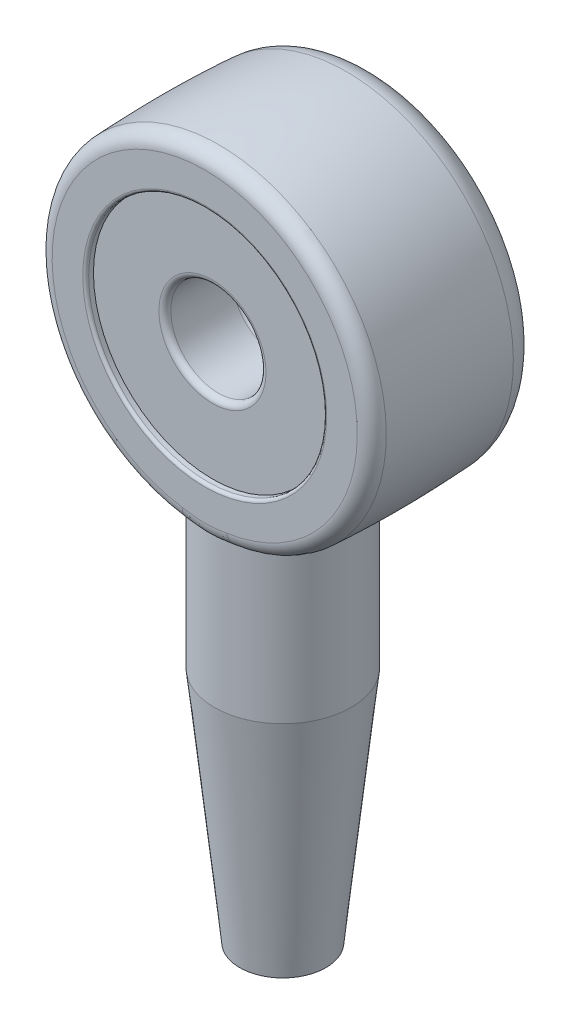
ISO-10303-21;
HEADER;
FILE_DESCRIPTION(('STEP AP214'),'2;1');
FILE_NAME('part.step','',(''),(''),'','','');
FILE_SCHEMA(('AUTOMOTIVE_DESIGN { 1 0 10303 214 1 1 1 1 }'));
ENDSEC;
DATA;
#1=APPLICATION_CONTEXT('core data for automotive mechanical design processes');
#2=APPLICATION_PROTOCOL_DEFINITION('international standard','automotive_design',2000,#1);
#3=PRODUCT_CONTEXT('',#1,'mechanical');
#4=PRODUCT('Part','Part','',(#3));
#5=PRODUCT_RELATED_PRODUCT_CATEGORY('part','',(#4));
#6=PRODUCT_DEFINITION_FORMATION('','',#4);
#7=PRODUCT_DEFINITION_CONTEXT('part definition',#1,'design');
#8=PRODUCT_DEFINITION('design','',#6,#7);
#9=PRODUCT_DEFINITION_SHAPE('','',#8);
#10=(LENGTH_UNIT() NAMED_UNIT(*) SI_UNIT(.MILLI.,.METRE.));
#11=(NAMED_UNIT(*) PLANE_ANGLE_UNIT() SI_UNIT($,.RADIAN.));
#12=(NAMED_UNIT(*) SI_UNIT($,.STERADIAN.) SOLID_ANGLE_UNIT());
#13=UNCERTAINTY_MEASURE_WITH_UNIT(LENGTH_MEASURE(1.E-05),#10,'distance_accuracy_value','');
#14=(GEOMETRIC_REPRESENTATION_CONTEXT(3) GLOBAL_UNCERTAINTY_ASSIGNED_CONTEXT((#13)) GLOBAL_UNIT_ASSIGNED_CONTEXT((#10,
#11,#12)) REPRESENTATION_CONTEXT('',''));
#15=CARTESIAN_POINT('',(0.,0.,0.));
#16=DIRECTION('',(0.,0.,1.));
#17=DIRECTION('',(1.,0.,0.));
#18=AXIS2_PLACEMENT_3D('',#15,#16,#17);
#19=CARTESIAN_POINT('',(0.,0.,-3.90593525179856));
#20=DIRECTION('',(0.,0.,-1.));
#21=DIRECTION('',(-1.,0.,0.));
#22=AXIS2_PLACEMENT_3D('',#19,#20,#21);
#23=PLANE('',#22);
#24=CARTESIAN_POINT('',(0.,0.,-3.90593525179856));
#25=DIRECTION('',(0.,0.,-1.));
#26=DIRECTION('',(-1.,0.,0.));
#27=AXIS2_PLACEMENT_3D('',#24,#25,#26);
#28=CIRCLE('',#27,5.52382853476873);
#29=CARTESIAN_POINT('',(-5.52382853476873,0.,-3.90593525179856));
#30=VERTEX_POINT('',#29);
#31=EDGE_CURVE('E558',#30,#30,#28,.F.);
#32=ORIENTED_EDGE('',*,*,#31,.T.);
#33=EDGE_LOOP('',(#32));
#34=FACE_BOUND('',#33,.T.);
#35=CARTESIAN_POINT('',(0.,0.,-3.90593525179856));
#36=DIRECTION('',(0.,0.,-1.));
#37=DIRECTION('',(-1.,0.,0.));
#38=AXIS2_PLACEMENT_3D('',#35,#36,#37);
#39=CIRCLE('',#38,5.86380692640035);
#40=CARTESIAN_POINT('',(-0.898680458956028,-5.79453234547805,-3.90593525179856));
#41=VERTEX_POINT('',#40);
#42=CARTESIAN_POINT('',(0.898680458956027,-5.79453234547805,-3.90593525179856));
#43=VERTEX_POINT('',#42);
#44=EDGE_CURVE('E257',#41,#43,#39,.T.);
#45=ORIENTED_EDGE('',*,*,#44,.T.);
#46=CARTESIAN_POINT('',(-1.89725886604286,-5.69981061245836,-3.90593525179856));
#47=CARTESIAN_POINT('',(-1.84100881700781,-7.43108537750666,-3.90593525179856));
#48=CARTESIAN_POINT('',(-1.85792729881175,-6.91036510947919,-2.25395445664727));
#49=CARTESIAN_POINT('',(-1.84340250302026,-5.69806177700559,-3.90593525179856));
#50=CARTESIAN_POINT('',(-1.82480322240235,-7.39542414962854,-3.90593525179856));
#51=CARTESIAN_POINT('',(-1.82918412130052,-6.91690139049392,-2.27763376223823));
#52=CARTESIAN_POINT('',(-1.7895249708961,-5.69800262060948,-3.90593525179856));
#53=CARTESIAN_POINT('',(-1.80307561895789,-7.3607517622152,-3.90593525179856));
#54=CARTESIAN_POINT('',(-1.79872554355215,-6.92367858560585,-2.30182575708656));
#55=CARTESIAN_POINT('',(-1.68189888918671,-5.70068897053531,-3.90593525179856));
#56=CARTESIAN_POINT('',(-1.75028169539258,-7.29521181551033,-3.90593525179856));
#57=CARTESIAN_POINT('',(-1.73414911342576,-6.93762125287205,-2.35086430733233));
#58=CARTESIAN_POINT('',(-1.62815026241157,-5.70343114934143,-3.90593525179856));
#59=CARTESIAN_POINT('',(-1.71945321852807,-7.26423884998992,-3.90593525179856));
#60=CARTESIAN_POINT('',(-1.70003564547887,-6.94478625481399,-2.37571005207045));
#61=CARTESIAN_POINT('',(-1.52110212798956,-5.71112413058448,-3.90593525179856));
#62=CARTESIAN_POINT('',(-1.65011921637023,-7.2067129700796,-3.90593525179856));
#63=CARTESIAN_POINT('',(-1.62804039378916,-6.95938909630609,-2.42561390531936));
#64=CARTESIAN_POINT('',(-1.46780173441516,-5.71606345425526,-3.90593525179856));
#65=CARTESIAN_POINT('',(-1.61182298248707,-7.18002663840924,-3.90593525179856));
#66=CARTESIAN_POINT('',(-1.59017897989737,-6.96682533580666,-2.45067025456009));
#67=CARTESIAN_POINT('',(-1.36136697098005,-5.72759021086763,-3.90593525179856));
#68=CARTESIAN_POINT('',(-1.52876081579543,-7.13096699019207,-3.90593525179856));
#69=CARTESIAN_POINT('',(-1.51029179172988,-6.9818778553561,-2.50069742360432));
#70=CARTESIAN_POINT('',(-1.30823265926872,-5.73417816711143,-3.90593525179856));
#71=CARTESIAN_POINT('',(-1.48410045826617,-7.10847916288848,-3.90593525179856));
#72=CARTESIAN_POINT('',(-1.46826469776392,-6.98949419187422,-2.52566821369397));
#73=CARTESIAN_POINT('',(-1.20245243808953,-5.74840606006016,-3.90593525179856));
#74=CARTESIAN_POINT('',(-1.3897666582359,-7.06782600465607,-3.90593525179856));
#75=CARTESIAN_POINT('',(-1.38018814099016,-7.00469327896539,-2.57484849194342));
#76=CARTESIAN_POINT('',(-1.14980556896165,-5.75603905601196,-3.90593525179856));
#77=CARTESIAN_POINT('',(-1.34018650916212,-7.04952962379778,-3.90593525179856));
#78=CARTESIAN_POINT('',(-1.33416589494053,-7.01227593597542,-2.59906180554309));
#79=CARTESIAN_POINT('',(-1.04460056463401,-5.77184845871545,-3.90593525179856));
#80=CARTESIAN_POINT('',(-1.2365751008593,-7.01673698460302,-3.90593525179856));
#81=CARTESIAN_POINT('',(-1.23765264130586,-7.02727667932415,-2.64638331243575));
#82=CARTESIAN_POINT('',(-0.992042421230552,-5.78002481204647,-3.90593525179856));
#83=CARTESIAN_POINT('',(-1.18255495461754,-7.00214746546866,-3.90593525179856));
#84=CARTESIAN_POINT('',(-1.18716207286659,-7.03469478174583,-2.669491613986));
#85=CARTESIAN_POINT('',(-0.886833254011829,-5.79637819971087,-3.90593525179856));
#86=CARTESIAN_POINT('',(-1.07067272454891,-6.97634513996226,-3.90593525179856));
#87=CARTESIAN_POINT('',(-1.08153644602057,-7.04913295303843,-2.71400063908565));
#88=CARTESIAN_POINT('',(-0.834182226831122,-5.80455521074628,-3.90593525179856));
#89=CARTESIAN_POINT('',(-1.01276843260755,-6.9650593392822,-3.90593525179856));
#90=CARTESIAN_POINT('',(-1.02639350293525,-7.05615231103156,-2.73539833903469));
#91=CARTESIAN_POINT('',(-0.728793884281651,-5.82037671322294,-3.90593525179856));
#92=CARTESIAN_POINT('',(-0.894047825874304,-6.9454899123,-3.90593525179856));
#93=CARTESIAN_POINT('',(-0.911862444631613,-7.06948886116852,-2.77567563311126));
#94=CARTESIAN_POINT('',(-0.676056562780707,-5.82802116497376,-3.90593525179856));
#95=CARTESIAN_POINT('',(-0.833148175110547,-6.93714302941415,-3.90593525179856));
#96=CARTESIAN_POINT('',(-0.85247401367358,-7.07580600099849,-2.7945550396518));
#97=CARTESIAN_POINT('',(-0.590274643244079,-5.83956404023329,-3.90593525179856));
#98=CARTESIAN_POINT('',(-0.731945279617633,-6.92557038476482,-3.90593525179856));
#99=CARTESIAN_POINT('',(-0.752655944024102,-7.08527763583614,-2.8226408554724));
#100=CARTESIAN_POINT('',(-0.557274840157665,-5.84379088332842,-3.90593525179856));
#101=CARTESIAN_POINT('',(-0.692603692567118,-6.92160009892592,-3.90593525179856));
#102=CARTESIAN_POINT('',(-0.713485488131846,-7.0887287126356,-2.83281669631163));
#103=CARTESIAN_POINT('',(-0.491212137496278,-5.85171428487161,-3.90593525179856));
#104=CARTESIAN_POINT('',(-0.61301772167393,-6.91452577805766,-3.90593525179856));
#105=CARTESIAN_POINT('',(-0.63361781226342,-7.09517233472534,-2.85174526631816));
#106=CARTESIAN_POINT('',(-0.45814923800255,-5.85541084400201,-3.90593525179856));
#107=CARTESIAN_POINT('',(-0.572738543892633,-6.91141261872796,-3.90593525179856));
#108=CARTESIAN_POINT('',(-0.592920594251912,-7.09816488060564,-2.86049799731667));
#109=CARTESIAN_POINT('',(-0.358864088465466,-5.86553145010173,-3.90593525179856));
#110=CARTESIAN_POINT('',(-0.451367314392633,-6.90326609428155,-3.90593525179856));
#111=CARTESIAN_POINT('',(-0.469134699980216,-7.10632831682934,-2.88430050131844));
#112=CARTESIAN_POINT('',(-0.292536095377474,-5.87098774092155,-3.90593525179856));
#113=CARTESIAN_POINT('',(-0.368834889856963,-6.89934003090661,-3.90593525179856));
#114=CARTESIAN_POINT('',(-0.384340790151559,-7.11068607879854,-2.89689774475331));
#115=CARTESIAN_POINT('',(-0.192974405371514,-5.87675990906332,-3.90593525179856));
#116=CARTESIAN_POINT('',(-0.243852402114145,-6.89533538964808,-3.90593525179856));
#117=CARTESIAN_POINT('',(-0.254796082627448,-7.11530047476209,-2.91018617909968));
#118=CARTESIAN_POINT('',(-0.159808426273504,-5.87828160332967,-3.90593525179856));
#119=CARTESIAN_POINT('',(-0.202052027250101,-6.89431213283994,-3.90593525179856));
#120=CARTESIAN_POINT('',(-0.211266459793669,-7.11651797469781,-2.9136803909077));
#121=CARTESIAN_POINT('',(-0.093448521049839,-5.88047141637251,-3.90593525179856));
#122=CARTESIAN_POINT('',(-0.118230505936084,-6.89285337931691,-3.90593525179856));
#123=CARTESIAN_POINT('',(-0.123724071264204,-7.11826817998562,-2.9187073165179));
#124=CARTESIAN_POINT('',(-0.0602545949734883,-5.88113953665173,-3.90593525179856));
#125=CARTESIAN_POINT('',(-0.0761565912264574,-6.89241600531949,-3.90593525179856));
#126=CARTESIAN_POINT('',(-0.0797113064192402,-7.11880088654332,-2.92024003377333));
#127=CARTESIAN_POINT('',(0.0393360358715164,-5.88183471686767,-3.90593525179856));
#128=CARTESIAN_POINT('',(0.0498534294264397,-6.89194854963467,-3.90593525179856));
#129=CARTESIAN_POINT('',(0.0522418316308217,-7.11935682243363,-2.92184722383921));
#130=CARTESIAN_POINT('',(0.105747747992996,-5.88055296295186,-3.90593525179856));
#131=CARTESIAN_POINT('',(0.133952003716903,-6.89276145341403,-3.90593525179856));
#132=CARTESIAN_POINT('',(0.140105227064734,-7.11833816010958,-2.91893157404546));
#133=CARTESIAN_POINT('',(0.20521557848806,-5.87613602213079,-3.90593525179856));
#134=CARTESIAN_POINT('',(0.259035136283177,-6.89576168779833,-3.90593525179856));
#135=CARTESIAN_POINT('',(0.270564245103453,-7.11480807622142,-2.90876521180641));
#136=CARTESIAN_POINT('',(0.238334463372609,-5.8742491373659,-3.90593525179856));
#137=CARTESIAN_POINT('',(0.300683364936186,-6.89706298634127,-3.90593525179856));
#138=CARTESIAN_POINT('',(0.313812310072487,-7.11329861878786,-2.90441359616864));
#139=CARTESIAN_POINT('',(0.304519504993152,-5.86970133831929,-3.90593525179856));
#140=CARTESIAN_POINT('',(0.383425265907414,-6.9003111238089,-3.90593525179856));
#141=CARTESIAN_POINT('',(0.399400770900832,-7.10965339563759,-2.89388747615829));
#142=CARTESIAN_POINT('',(0.33758566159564,-5.86704042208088,-3.90593525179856));
#143=CARTESIAN_POINT('',(0.424567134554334,-6.9022621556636,-3.90593525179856));
#144=CARTESIAN_POINT('',(0.441741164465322,-7.10751762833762,-2.88771296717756));
#145=CARTESIAN_POINT('',(0.436693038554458,-5.85802580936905,-3.90593525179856));
#146=CARTESIAN_POINT('',(0.54718537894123,-6.90919041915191,-3.90593525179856));
#147=CARTESIAN_POINT('',(0.566984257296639,-7.10027433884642,-2.86668792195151));
#148=CARTESIAN_POINT('',(0.502640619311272,-5.85064037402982,-3.90593525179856));
#149=CARTESIAN_POINT('',(0.62754229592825,-6.91524754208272,-3.90593525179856));
#150=CARTESIAN_POINT('',(0.648105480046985,-7.09433092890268,-2.84933614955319));
#151=CARTESIAN_POINT('',(0.601437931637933,-5.83810912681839,-3.90593525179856));
#152=CARTESIAN_POINT('',(0.745031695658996,-6.92696476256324,-3.90593525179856));
#153=CARTESIAN_POINT('',(0.765643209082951,-7.08410441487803,-2.81916089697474));
#154=CARTESIAN_POINT('',(0.634384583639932,-5.83368439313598,-3.90593525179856));
#155=CARTESIAN_POINT('',(0.783979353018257,-6.93135014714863,-3.90593525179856));
#156=CARTESIAN_POINT('',(0.8041704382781,-7.08047245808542,-2.80839758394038));
#157=CARTESIAN_POINT('',(0.700227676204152,-5.82447284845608,-3.90593525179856));
#158=CARTESIAN_POINT('',(0.860727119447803,-6.94110480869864,-3.90593525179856));
#159=CARTESIAN_POINT('',(0.879533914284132,-7.07285921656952,-2.78571391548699));
#160=CARTESIAN_POINT('',(0.733124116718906,-5.81968603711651,-3.90593525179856));
#161=CARTESIAN_POINT('',(0.898552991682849,-6.94648638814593,-3.90593525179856));
#162=CARTESIAN_POINT('',(0.916370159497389,-7.06887793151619,-2.77379355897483));
#163=CARTESIAN_POINT('',(0.831759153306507,-5.8049821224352,-3.90593525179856));
#164=CARTESIAN_POINT('',(1.01068337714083,-6.96435345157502,-3.90593525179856));
#165=CARTESIAN_POINT('',(1.02430871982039,-7.05652323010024,-2.73656382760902));
#166=CARTESIAN_POINT('',(0.897445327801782,-5.79472128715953,-3.90593525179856));
#167=CARTESIAN_POINT('',(1.08276452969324,-6.97849333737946,-3.90593525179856));
#168=CARTESIAN_POINT('',(1.09284308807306,-7.04773876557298,-2.70978519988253));
#169=CARTESIAN_POINT('',(1.03250499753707,-5.77374333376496,-3.90593525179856));
#170=CARTESIAN_POINT('',(1.22495360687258,-7.01291570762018,-3.90593525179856));
#171=CARTESIAN_POINT('',(1.2266324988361,-7.02906425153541,-2.65201897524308));
#172=CARTESIAN_POINT('',(1.10187955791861,-5.7630327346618,-3.90593525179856));
#173=CARTESIAN_POINT('',(1.2947072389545,-7.03365862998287,-3.90593525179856));
#174=CARTESIAN_POINT('',(1.29149067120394,-7.01913985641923,-2.62087984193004));
#175=CARTESIAN_POINT('',(1.24074040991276,-5.74301198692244,-3.90593525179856));
#176=CARTESIAN_POINT('',(1.42574351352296,-7.08160280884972,-3.90593525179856));
#177=CARTESIAN_POINT('',(1.41336904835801,-6.99919246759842,-2.55721774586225));
#178=CARTESIAN_POINT('',(1.31022642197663,-5.73369995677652,-3.90593525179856));
#179=CARTESIAN_POINT('',(1.48696350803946,-7.10902299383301,-3.90593525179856));
#180=CARTESIAN_POINT('',(1.47039977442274,-6.98916962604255,-2.52469671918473));
#181=CARTESIAN_POINT('',(1.44945145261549,-5.7177066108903,-3.90593525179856));
#182=CARTESIAN_POINT('',(1.59915735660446,-7.17085757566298,-3.90593525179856));
#183=CARTESIAN_POINT('',(1.57728429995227,-6.96938708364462,-2.45933599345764));
#184=CARTESIAN_POINT('',(1.5191901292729,-5.71102254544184,-3.90593525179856));
#185=CARTESIAN_POINT('',(1.64993152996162,-7.20552587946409,-3.90593525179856));
#186=CARTESIAN_POINT('',(1.62714556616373,-6.95962711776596,-2.42649666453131));
#187=CARTESIAN_POINT('',(1.65910960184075,-5.70150480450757,-3.90593525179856));
#188=CARTESIAN_POINT('',(1.73880747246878,-7.28161459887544,-3.90593525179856));
#189=CARTESIAN_POINT('',(1.7203496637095,-6.94060327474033,-2.36132174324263));
#190=CARTESIAN_POINT('',(1.72929108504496,-5.69868169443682,-3.90593525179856));
#191=CARTESIAN_POINT('',(1.77649133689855,-7.32330478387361,-3.90593525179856));
#192=CARTESIAN_POINT('',(1.76367432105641,-6.93134082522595,-2.3289877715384));
#193=CARTESIAN_POINT('',(1.79956157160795,-5.69842922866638,-3.90593525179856));
#194=CARTESIAN_POINT('',(1.80546311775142,-7.36730045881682,-3.90593525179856));
#195=CARTESIAN_POINT('',(1.80389011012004,-6.92247682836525,-2.29742803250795));
#196=(BOUNDED_SURFACE() B_SPLINE_SURFACE(3,2,((#46,#47,#48),(#49,#50,#51),(#52,#53,#54),(#55,
#56,#57),(#58,#59,#60),(#61,#62,#63),(#64,#65,#66),(#67,#68,#69),(#70,#71,#72),(#73,#74,#75),
(#76,#77,#78),(#79,#80,#81),(#82,#83,#84),(#85,#86,#87),(#88,#89,#90),(#91,#92,#93),(#94,#95,
#96),(#97,#98,#99),(#100,#101,#102),(#103,#104,#105),(#106,#107,#108),(#109,#110,#111),(#112,
#113,#114),(#115,#116,#117),(#118,#119,#120),(#121,#122,#123),(#124,#125,#126),(#127,#128,#129),
(#130,#131,#132),(#133,#134,#135),(#136,#137,#138),(#139,#140,#141),(#142,#143,#144),(#145,#146,
#147),(#148,#149,#150),(#151,#152,#153),(#154,#155,#156),(#157,#158,#159),(#160,#161,#162),
(#163,#164,#165),(#166,#167,#168),(#169,#170,#171),(#172,#173,#174),(#175,#176,#177),(#178,#179,
#180),(#181,#182,#183),(#184,#185,#186),(#187,#188,#189),(#190,#191,#192),(#193,#194,#195)),
.UNSPECIFIED.,.F.,.F.,.F.) B_SPLINE_SURFACE_WITH_KNOTS((4,2,2,2,2,2,2,2,2,2,2,2,2,2,2,2,2,2,2,2,
2,2,2,2,4),(3,3),(0.,0.161579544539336,0.322967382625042,0.483521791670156,0.644127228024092,
0.803713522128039,0.96328414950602,1.12313086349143,1.28298947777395,1.3827936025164,
1.48259759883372,1.68217745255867,1.78177038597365,1.8813631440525,2.08053018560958,
2.1800408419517,2.27955174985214,2.47858120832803,2.57830778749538,2.67803446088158,
2.87748216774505,3.08806804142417,3.29836802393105,3.50844737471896,3.71910046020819),(0.,1.),
.UNSPECIFIED.) GEOMETRIC_REPRESENTATION_ITEM() RATIONAL_B_SPLINE_SURFACE(((1.,0.591281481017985,
1.),(1.,0.599167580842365,1.),(1.,0.607061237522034,1.),(1.,0.622758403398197,1.),(1.,
0.630562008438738,1.),(1.,0.645953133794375,1.),(1.,0.653541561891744,1.),(1.,0.668440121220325,
1.),(1.,0.675750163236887,1.),(1.,0.689927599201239,1.),(1.,0.696797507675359,1.),(1.,
0.71004029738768,1.),(1.,0.71641322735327,1.),(1.,0.72854045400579,1.),(1.,0.734293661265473,
1.),(1.,0.745013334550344,1.),(1.,0.749979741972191,1.),(1.,0.757307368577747,1.),(1.,
0.759946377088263,1.),(1.,0.764833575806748,1.),(1.,0.767081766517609,1.),(1.,0.773174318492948,
1.),(1.,0.776367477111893,1.),(1.,0.779726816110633,1.),(1.,0.780608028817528,1.),(1.,
0.781874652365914,1.),(1.,0.782260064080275,1.),(1.,0.782664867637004,1.),(1.,0.781933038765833,
1.),(1.,0.779367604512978,1.),(1.,0.77826851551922,1.),(1.,0.775601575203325,1.),(1.,
0.774033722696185,1.),(1.,0.768674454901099,1.),(1.,0.764227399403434,1.),(1.,0.756401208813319,
1.),(1.,0.753596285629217,1.),(1.,0.747647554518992,1.),(1.,0.744503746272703,1.),(1.,
0.734616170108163,1.),(1.,0.727416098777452,1.),(1.,0.711616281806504,1.),(1.,0.702960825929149,
1.),(1.,0.684901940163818,1.),(1.,0.675499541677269,1.),(1.,0.656174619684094,1.),(1.,
0.646252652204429,1.),(1.,0.626090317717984,1.),(1.,0.615849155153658,1.),(1.,0.605581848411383,1.))) REPRESENTATION_ITEM('') SURFACE());
#197=CARTESIAN_POINT('',(1.79956157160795,-5.69842922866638,-3.90593525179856));
#198=CARTESIAN_POINT('',(1.72929108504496,-5.69868169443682,-3.90593525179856));
#199=CARTESIAN_POINT('',(1.65910960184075,-5.70150480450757,-3.90593525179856));
#200=CARTESIAN_POINT('',(1.5191901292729,-5.71102254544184,-3.90593525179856));
#201=CARTESIAN_POINT('',(1.44945145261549,-5.7177066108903,-3.90593525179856));
#202=CARTESIAN_POINT('',(1.31022642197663,-5.73369995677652,-3.90593525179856));
#203=CARTESIAN_POINT('',(1.24074040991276,-5.74301198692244,-3.90593525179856));
#204=CARTESIAN_POINT('',(1.10187955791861,-5.7630327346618,-3.90593525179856));
#205=CARTESIAN_POINT('',(1.03250499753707,-5.77374333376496,-3.90593525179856));
#206=CARTESIAN_POINT('',(0.897445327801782,-5.79472128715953,-3.90593525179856));
#207=CARTESIAN_POINT('',(0.831759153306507,-5.8049821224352,-3.90593525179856));
#208=CARTESIAN_POINT('',(0.733124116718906,-5.81968603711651,-3.90593525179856));
#209=CARTESIAN_POINT('',(0.700227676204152,-5.82447284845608,-3.90593525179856));
#210=CARTESIAN_POINT('',(0.634384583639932,-5.83368439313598,-3.90593525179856));
#211=CARTESIAN_POINT('',(0.601437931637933,-5.83810912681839,-3.90593525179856));
#212=CARTESIAN_POINT('',(0.502640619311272,-5.85064037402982,-3.90593525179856));
#213=CARTESIAN_POINT('',(0.436693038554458,-5.85802580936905,-3.90593525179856));
#214=CARTESIAN_POINT('',(0.33758566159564,-5.86704042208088,-3.90593525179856));
#215=CARTESIAN_POINT('',(0.304519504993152,-5.86970133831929,-3.90593525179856));
#216=CARTESIAN_POINT('',(0.238334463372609,-5.8742491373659,-3.90593525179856));
#217=CARTESIAN_POINT('',(0.20521557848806,-5.87613602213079,-3.90593525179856));
#218=CARTESIAN_POINT('',(0.105747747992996,-5.88055296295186,-3.90593525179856));
#219=CARTESIAN_POINT('',(0.0393360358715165,-5.88183471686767,-3.90593525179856));
#220=CARTESIAN_POINT('',(-0.0602545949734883,-5.88113953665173,-3.90593525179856));
#221=CARTESIAN_POINT('',(-0.093448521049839,-5.88047141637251,-3.90593525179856));
#222=CARTESIAN_POINT('',(-0.159808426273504,-5.87828160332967,-3.90593525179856));
#223=CARTESIAN_POINT('',(-0.192974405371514,-5.87675990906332,-3.90593525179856));
#224=CARTESIAN_POINT('',(-0.292536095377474,-5.87098774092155,-3.90593525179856));
#225=CARTESIAN_POINT('',(-0.358864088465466,-5.86553145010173,-3.90593525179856));
#226=CARTESIAN_POINT('',(-0.45814923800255,-5.85541084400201,-3.90593525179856));
#227=CARTESIAN_POINT('',(-0.491212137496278,-5.85171428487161,-3.90593525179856));
#228=CARTESIAN_POINT('',(-0.557274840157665,-5.84379088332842,-3.90593525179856));
#229=CARTESIAN_POINT('',(-0.590274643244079,-5.83956404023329,-3.90593525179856));
#230=CARTESIAN_POINT('',(-0.676056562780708,-5.82802116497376,-3.90593525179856));
#231=CARTESIAN_POINT('',(-0.728793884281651,-5.82037671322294,-3.90593525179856));
#232=CARTESIAN_POINT('',(-0.834182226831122,-5.80455521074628,-3.90593525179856));
#233=CARTESIAN_POINT('',(-0.886833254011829,-5.79637819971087,-3.90593525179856));
#234=CARTESIAN_POINT('',(-0.992042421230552,-5.78002481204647,-3.90593525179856));
#235=CARTESIAN_POINT('',(-1.04460056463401,-5.77184845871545,-3.90593525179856));
#236=CARTESIAN_POINT('',(-1.14980556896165,-5.75603905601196,-3.90593525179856));
#237=CARTESIAN_POINT('',(-1.20245243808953,-5.74840606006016,-3.90593525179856));
#238=CARTESIAN_POINT('',(-1.30823265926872,-5.73417816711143,-3.90593525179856));
#239=CARTESIAN_POINT('',(-1.36136697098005,-5.72759021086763,-3.90593525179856));
#240=CARTESIAN_POINT('',(-1.46780173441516,-5.71606345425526,-3.90593525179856));
#241=CARTESIAN_POINT('',(-1.52110212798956,-5.71112413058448,-3.90593525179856));
#242=CARTESIAN_POINT('',(-1.62815026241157,-5.70343114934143,-3.90593525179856));
#243=CARTESIAN_POINT('',(-1.68189888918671,-5.70068897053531,-3.90593525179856));
#244=CARTESIAN_POINT('',(-1.7895249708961,-5.69800262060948,-3.90593525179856));
#245=CARTESIAN_POINT('',(-1.84340250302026,-5.69806177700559,-3.90593525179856));
#246=CARTESIAN_POINT('',(-1.89725886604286,-5.69981061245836,-3.90593525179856));
#247=B_SPLINE_CURVE_WITH_KNOTS('',3,(#197,#198,#199,#200,#201,#202,#203,#204,#205,#206,#207,
#208,#209,#210,#211,#212,#213,#214,#215,#216,#217,#218,#219,#220,#221,#222,#223,#224,#225,#226,
#227,#228,#229,#230,#231,#232,#233,#234,#235,#236,#237,#238,#239,#240,#241,#242,#243,#244,#245,
#246),.UNSPECIFIED.,.F.,.F.,(4,2,2,2,2,2,2,2,2,2,2,2,2,2,2,2,2,2,2,2,2,2,2,2,4),(0.,
0.210653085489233,0.420732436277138,0.631032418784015,0.841618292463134,1.04106599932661,
1.14079267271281,1.24051925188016,1.43954871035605,1.53905961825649,1.63857027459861,
1.83773731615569,1.93733007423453,2.03692300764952,2.23650286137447,2.33630685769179,
2.43611098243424,2.59596959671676,2.75581631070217,2.91538693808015,3.0749732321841,
3.23557866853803,3.39613307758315,3.55752091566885,3.71910046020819),.UNSPECIFIED.);
#248=EDGE_CURVE('E250',#43,#41,#247,.T.);
#249=ORIENTED_EDGE('',*,*,#248,.T.);
#250=EDGE_LOOP('',(#45,#249));
#251=FACE_BOUND('',#250,.T.);
#252=ADVANCED_FACE('F40',(#34,#251),#23,.T.);
#253=CARTESIAN_POINT('',(0.,7.0485,-3.90593525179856));
#254=CARTESIAN_POINT('',(0.,7.34356925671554,-0.287985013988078));
#255=CARTESIAN_POINT('',(0.,7.112,3.33306474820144));
#256=B_SPLINE_CURVE_WITH_KNOTS('',2,(#253,#254,#255),.UNSPECIFIED.,.F.,.F.,(3,3),(0.,1.),.UNSPECIFIED.);
#257=CARTESIAN_POINT('',(0.,0.,-3.90593525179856));
#258=DIRECTION('',(0.,0.,-1.));
#259=AXIS1_PLACEMENT('',#257,#258);
#260=SURFACE_OF_REVOLUTION('',#256,#259);
#261=CARTESIAN_POINT('',(0.,-7.13664749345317,2.921));
#262=CARTESIAN_POINT('',(-0.0793742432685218,-7.13664726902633,2.92099953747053));
#263=CARTESIAN_POINT('',(-0.158748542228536,-7.13549971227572,2.91775994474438));
#264=CARTESIAN_POINT('',(-0.31691458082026,-7.1309459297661,2.90484330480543));
#265=CARTESIAN_POINT('',(-0.395706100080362,-7.12753888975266,2.89516393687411));
#266=CARTESIAN_POINT('',(-0.63026015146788,-7.11404419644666,2.8565800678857));
#267=CARTESIAN_POINT('',(-0.78438304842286,-7.10068268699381,2.81812955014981));
#268=CARTESIAN_POINT('',(-1.08327782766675,-7.06663512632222,2.71728432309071));
#269=CARTESIAN_POINT('',(-1.22806586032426,-7.04596215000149,2.6549323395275));
#270=CARTESIAN_POINT('',(-1.50514090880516,-6.99934581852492,2.50825899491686));
#271=CARTESIAN_POINT('',(-1.63742504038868,-6.97340125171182,2.4239325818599));
#272=CARTESIAN_POINT('',(-1.89076781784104,-6.91779952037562,2.23233723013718));
#273=CARTESIAN_POINT('',(-2.01128254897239,-6.88804522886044,2.12437783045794));
#274=CARTESIAN_POINT('',(-2.23292700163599,-6.82862361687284,1.89005230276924));
#275=CARTESIAN_POINT('',(-2.33405152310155,-6.79895632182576,1.76368125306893));
#276=CARTESIAN_POINT('',(-2.51742376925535,-6.74192434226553,1.4908818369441));
#277=CARTESIAN_POINT('',(-2.5989127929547,-6.71467224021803,1.34391761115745));
#278=CARTESIAN_POINT('',(-2.73577992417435,-6.66702178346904,1.03726227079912));
#279=CARTESIAN_POINT('',(-2.79116700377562,-6.64662107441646,0.877575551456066));
#280=CARTESIAN_POINT('',(-2.87218869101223,-6.61598198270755,0.556092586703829));
#281=CARTESIAN_POINT('',(-2.89883225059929,-6.60540094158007,0.394584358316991));
#282=CARTESIAN_POINT('',(-2.92473970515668,-6.59456371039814,0.0690681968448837));
#283=CARTESIAN_POINT('',(-2.92401373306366,-6.59430369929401,-0.0949387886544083));
#284=CARTESIAN_POINT('',(-2.8960015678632,-6.60382252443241,-0.411479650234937));
#285=CARTESIAN_POINT('',(-2.87013580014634,-6.61306601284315,-0.564158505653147));
#286=CARTESIAN_POINT('',(-2.79489410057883,-6.6395935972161,-0.862866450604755));
#287=CARTESIAN_POINT('',(-2.7455149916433,-6.65687877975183,-1.00889463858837));
#288=CARTESIAN_POINT('',(-2.62387066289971,-6.69779840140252,-1.29298901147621));
#289=CARTESIAN_POINT('',(-2.55124226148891,-6.72153262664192,-1.43088466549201));
#290=CARTESIAN_POINT('',(-2.38541010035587,-6.7725986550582,-1.69296351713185));
#291=CARTESIAN_POINT('',(-2.29219990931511,-6.79993158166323,-1.81714241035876));
#292=CARTESIAN_POINT('',(-2.08135942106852,-6.85704955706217,-2.05597331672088));
#293=CARTESIAN_POINT('',(-1.96261195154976,-6.88688408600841,-2.16962944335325));
#294=CARTESIAN_POINT('',(-1.70739811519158,-6.94421985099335,-2.37569673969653));
#295=CARTESIAN_POINT('',(-1.57092963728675,-6.9717208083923,-2.46810537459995));
#296=CARTESIAN_POINT('',(-1.28180512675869,-7.02173329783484,-2.63001901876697));
#297=CARTESIAN_POINT('',(-1.12896668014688,-7.04417754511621,-2.69922054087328));
#298=CARTESIAN_POINT('',(-0.812843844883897,-7.08106209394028,-2.81061937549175));
#299=CARTESIAN_POINT('',(-0.649563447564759,-7.09550543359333,-2.85282693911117));
#300=CARTESIAN_POINT('',(-0.325406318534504,-7.11424686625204,-2.90724765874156));
#301=CARTESIAN_POINT('',(-0.164775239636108,-7.11898847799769,-2.92077316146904));
#302=CARTESIAN_POINT('',(0.15651648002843,-7.11914398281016,-2.92122100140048));
#303=CARTESIAN_POINT('',(0.317177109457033,-7.11455963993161,-2.90814836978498));
#304=CARTESIAN_POINT('',(0.628496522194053,-7.0968731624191,-2.85680527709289));
#305=CARTESIAN_POINT('',(0.779310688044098,-7.08405228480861,-2.81936633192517));
#306=CARTESIAN_POINT('',(1.07249962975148,-7.05144338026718,-2.72137031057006));
#307=CARTESIAN_POINT('',(1.21487333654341,-7.0316544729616,-2.66081031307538));
#308=CARTESIAN_POINT('',(1.42123026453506,-6.99792161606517,-2.55315742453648));
#309=CARTESIAN_POINT('',(1.48968770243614,-6.98581006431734,-2.51382011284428));
#310=CARTESIAN_POINT('',(1.62306588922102,-6.96057403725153,-2.42983532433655));
#311=CARTESIAN_POINT('',(1.68798745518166,-6.94744979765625,-2.38518908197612));
#312=CARTESIAN_POINT('',(1.81391624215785,-6.92051525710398,-2.29088132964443));
#313=CARTESIAN_POINT('',(1.87492382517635,-6.90670501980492,-2.24122028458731));
#314=CARTESIAN_POINT('',(1.99274490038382,-6.87873211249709,-2.13714729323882));
#315=CARTESIAN_POINT('',(2.04955399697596,-6.86456909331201,-2.08273049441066));
#316=CARTESIAN_POINT('',(2.21851788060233,-6.8206976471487,-1.90725072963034));
#317=CARTESIAN_POINT('',(2.32297451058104,-6.79099052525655,-1.77859897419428));
#318=CARTESIAN_POINT('',(2.50891632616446,-6.7350362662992,-1.50496539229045));
#319=CARTESIAN_POINT('',(2.59040580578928,-6.70878848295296,-1.35998662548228));
#320=CARTESIAN_POINT('',(2.69352801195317,-6.6744365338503,-1.13317187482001));
#321=CARTESIAN_POINT('',(2.72473287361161,-6.66381646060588,-1.05594808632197));
#322=CARTESIAN_POINT('',(2.78047953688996,-6.64460425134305,-0.898943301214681));
#323=CARTESIAN_POINT('',(2.80502744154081,-6.63601025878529,-0.819164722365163));
#324=CARTESIAN_POINT('',(2.84723878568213,-6.62114678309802,-0.657605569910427));
#325=CARTESIAN_POINT('',(2.86490288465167,-6.6148770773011,-0.575825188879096));
#326=CARTESIAN_POINT('',(2.8931677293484,-6.6048897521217,-0.410879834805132));
#327=CARTESIAN_POINT('',(2.9037673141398,-6.6011725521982,-0.327714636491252));
#328=CARTESIAN_POINT('',(2.91737388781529,-6.59657212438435,-0.165542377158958));
#329=CARTESIAN_POINT('',(2.92078479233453,-6.59553733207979,-0.0865732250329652));
#330=CARTESIAN_POINT('',(2.92119553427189,-6.59590005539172,0.0714119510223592));
#331=CARTESIAN_POINT('',(2.91819258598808,-6.59729862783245,0.15042798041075));
#332=CARTESIAN_POINT('',(2.90580458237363,-6.60248800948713,0.307852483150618));
#333=CARTESIAN_POINT('',(2.89642152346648,-6.60627807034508,0.386261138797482));
#334=CARTESIAN_POINT('',(2.87137155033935,-6.61613054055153,0.541923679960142));
#335=CARTESIAN_POINT('',(2.85570448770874,-6.62219300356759,0.619177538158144));
#336=CARTESIAN_POINT('',(2.81866882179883,-6.63623815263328,0.770230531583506));
#337=CARTESIAN_POINT('',(2.79743930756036,-6.644173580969,0.844068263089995));
#338=CARTESIAN_POINT('',(2.74931589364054,-6.66180160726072,0.989635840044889));
#339=CARTESIAN_POINT('',(2.72242330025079,-6.67149379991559,1.06136616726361));
#340=CARTESIAN_POINT('',(2.66318334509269,-6.69236694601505,1.20230453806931));
#341=CARTESIAN_POINT('',(2.63083668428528,-6.70354770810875,1.27151290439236));
#342=CARTESIAN_POINT('',(2.5609015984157,-6.72710679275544,1.40707209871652));
#343=CARTESIAN_POINT('',(2.52330860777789,-6.73948615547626,1.47342037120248));
#344=CARTESIAN_POINT('',(2.39913814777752,-6.77919024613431,1.67386763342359));
#345=CARTESIAN_POINT('',(2.30403491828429,-6.80802337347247,1.80251367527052));
#346=CARTESIAN_POINT('',(2.09424154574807,-6.86651458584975,2.04249973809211));
#347=CARTESIAN_POINT('',(1.97954760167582,-6.89617283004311,2.15383639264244));
#348=CARTESIAN_POINT('',(1.79209880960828,-6.93967162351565,2.30815813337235));
#349=CARTESIAN_POINT('',(1.72540894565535,-6.95431395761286,2.35842933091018));
#350=CARTESIAN_POINT('',(1.58787372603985,-6.9825962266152,2.45313194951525));
#351=CARTESIAN_POINT('',(1.5170323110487,-6.99623708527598,2.49756878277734));
#352=CARTESIAN_POINT('',(1.37158920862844,-7.02215198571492,2.58030771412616));
#353=CARTESIAN_POINT('',(1.29698642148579,-7.03442562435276,2.6186080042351));
#354=CARTESIAN_POINT('',(1.14452497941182,-7.05725972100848,2.68874407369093));
#355=CARTESIAN_POINT('',(1.0666656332,-7.06781981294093,2.72057847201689));
#356=CARTESIAN_POINT('',(0.908795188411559,-7.08685628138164,2.77728646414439));
#357=CARTESIAN_POINT('',(0.828801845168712,-7.09534604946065,2.80220494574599));
#358=CARTESIAN_POINT('',(0.666741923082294,-7.11008945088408,2.84512299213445));
#359=CARTESIAN_POINT('',(0.584674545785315,-7.11634220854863,2.86311984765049));
#360=CARTESIAN_POINT('',(0.419206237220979,-7.12641852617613,2.89198113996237));
#361=CARTESIAN_POINT('',(0.335806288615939,-7.13024379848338,2.90285060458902));
#362=CARTESIAN_POINT('',(0.168271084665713,-7.13535886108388,2.91736159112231));
#363=CARTESIAN_POINT('',(0.0841355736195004,-7.13664773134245,2.92100049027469));
#364=CARTESIAN_POINT('',(0.,-7.13664749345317,2.921));
#365=B_SPLINE_CURVE_WITH_KNOTS('',3,(#261,#262,#263,#264,#265,#266,#267,#268,#269,#270,#271,
#272,#273,#274,#275,#276,#277,#278,#279,#280,#281,#282,#283,#284,#285,#286,#287,#288,#289,#290,
#291,#292,#293,#294,#295,#296,#297,#298,#299,#300,#301,#302,#303,#304,#305,#306,#307,#308,#309,
#310,#311,#312,#313,#314,#315,#316,#317,#318,#319,#320,#321,#322,#323,#324,#325,#326,#327,#328,
#329,#330,#331,#332,#333,#334,#335,#336,#337,#338,#339,#340,#341,#342,#343,#344,#345,#346,#347,
#348,#349,#350,#351,#352,#353,#354,#355,#356,#357,#358,#359,#360,#361,#362,#363,#364),
.UNSPECIFIED.,.T.,.F.,(4,2,2,2,2,2,2,2,2,2,2,2,2,2,2,2,2,2,2,2,2,2,2,2,2,2,2,2,2,2,2,2,2,2,2,2,
2,2,2,2,2,2,2,2,2,2,2,2,2,2,2,4),(0.,0.238039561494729,0.476164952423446,0.951880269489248,
1.42674914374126,1.90172728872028,2.39307313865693,2.88455057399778,3.39273805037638,
3.90075071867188,4.39028461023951,4.87963726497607,5.34285776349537,5.80614086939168,
6.27704644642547,6.7480993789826,7.24697430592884,7.74590871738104,8.25113426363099,
8.75616783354,9.23754540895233,9.71883193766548,10.1844992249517,10.6502253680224,
10.8896438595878,11.1290067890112,11.3683475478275,11.6079354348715,12.1105164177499,
12.6130033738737,12.8646225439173,13.1160102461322,13.3673738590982,13.6187787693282,
13.8556337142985,14.0925915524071,14.3294752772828,14.5663645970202,14.7978177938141,
15.0292176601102,15.2605878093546,15.4921605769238,15.9775643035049,16.4630623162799,
16.7171668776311,16.971034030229,17.2249758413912,17.4789718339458,17.7312785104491,
17.9836838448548,18.2359109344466,18.4882294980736),.UNSPECIFIED.);
#366=CARTESIAN_POINT('',(1.09299861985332,-7.04746141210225,-2.70879955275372));
#367=VERTEX_POINT('',#366);
#368=CARTESIAN_POINT('',(1.03640532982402,-7.07131973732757,2.73095312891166));
#369=VERTEX_POINT('',#368);
#370=EDGE_CURVE('E173',#367,#369,#365,.T.);
#371=ORIENTED_EDGE('',*,*,#370,.F.);
#372=CARTESIAN_POINT('',(0.,0.,-2.70879955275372));
#373=DIRECTION('',(0.,0.,-1.));
#374=DIRECTION('',(-1.,0.,0.));
#375=AXIS2_PLACEMENT_3D('',#372,#373,#374);
#376=CIRCLE('',#375,7.13171496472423);
#377=CARTESIAN_POINT('',(-1.09299861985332,-7.04746141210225,-2.70879955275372));
#378=VERTEX_POINT('',#377);
#379=EDGE_CURVE('E179',#367,#378,#376,.F.);
#380=ORIENTED_EDGE('',*,*,#379,.T.);
#381=CARTESIAN_POINT('',(-1.03640532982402,-7.07131973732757,2.73095312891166));
#382=VERTEX_POINT('',#381);
#383=EDGE_CURVE('E166',#382,#378,#365,.T.);
#384=ORIENTED_EDGE('',*,*,#383,.F.);
#385=CARTESIAN_POINT('',(0.,0.,2.73095312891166));
#386=DIRECTION('',(0.,0.,-1.));
#387=DIRECTION('',(-1.,0.,0.));
#388=AXIS2_PLACEMENT_3D('',#385,#386,#387);
#389=CIRCLE('',#388,7.1468663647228);
#390=EDGE_CURVE('E161',#382,#369,#389,.T.);
#391=ORIENTED_EDGE('',*,*,#390,.T.);
#392=EDGE_LOOP('',(#371,#380,#384,#391));
#393=FACE_BOUND('',#392,.T.);
#394=ADVANCED_FACE('F177',(#393),#260,.F.);
#395=CARTESIAN_POINT('',(0.,0.,3.33306474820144));
#396=DIRECTION('',(0.,0.,1.));
#397=DIRECTION('',(1.,0.,0.));
#398=AXIS2_PLACEMENT_3D('',#395,#396,#397);
#399=PLANE('',#398);
#400=CARTESIAN_POINT('',(0.,0.,3.33306474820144));
#401=DIRECTION('',(0.,0.,1.));
#402=DIRECTION('',(1.,0.,0.));
#403=AXIS2_PLACEMENT_3D('',#400,#401,#402);
#404=CIRCLE('',#403,5.207);
#405=CARTESIAN_POINT('',(5.207,0.,3.33306474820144));
#406=VERTEX_POINT('',#405);
#407=EDGE_CURVE('E818',#406,#406,#404,.F.);
#408=ORIENTED_EDGE('',*,*,#407,.T.);
#409=EDGE_LOOP('',(#408));
#410=FACE_BOUND('',#409,.T.);
#411=CARTESIAN_POINT('',(-1.53801007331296,-6.99193146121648,2.48328977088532));
#412=CARTESIAN_POINT('',(-1.52809096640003,-7.29719017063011,3.33306474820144));
#413=CARTESIAN_POINT('',(-1.55741747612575,-6.39467217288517,3.33306474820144));
#414=CARTESIAN_POINT('',(-1.49413295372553,-7.00027159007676,2.51046921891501));
#415=CARTESIAN_POINT('',(-1.49746760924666,-7.25352549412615,3.33306474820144));
#416=CARTESIAN_POINT('',(-1.49280085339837,-6.39264854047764,3.33306474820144));
#417=CARTESIAN_POINT('',(-1.44740240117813,-7.0087917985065,2.53779252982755));
#418=CARTESIAN_POINT('',(-1.45608482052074,-7.2151688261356,3.33306474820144));
#419=CARTESIAN_POINT('',(-1.42824010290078,-6.39387453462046,3.33306474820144));
#420=CARTESIAN_POINT('',(-1.34865407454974,-7.02580592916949,2.59161589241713));
#421=CARTESIAN_POINT('',(-1.36065964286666,-7.15075681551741,3.33306474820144));
#422=CARTESIAN_POINT('',(-1.29962453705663,-6.40092096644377,3.33306474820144));
#423=CARTESIAN_POINT('',(-1.29665978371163,-7.03429980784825,2.61811896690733));
#424=CARTESIAN_POINT('',(-1.30707473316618,-7.12386737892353,3.33306474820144));
#425=CARTESIAN_POINT('',(-1.23556873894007,-6.40672171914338,3.33306474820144));
#426=CARTESIAN_POINT('',(-1.18730674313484,-7.05097013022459,2.66949577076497));
#427=CARTESIAN_POINT('',(-1.19257267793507,-7.07986146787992,3.33306474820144));
#428=CARTESIAN_POINT('',(-1.10766454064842,-6.42104327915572,3.33306474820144));
#429=CARTESIAN_POINT('',(-1.12993667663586,-7.05914585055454,2.69436586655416));
#430=CARTESIAN_POINT('',(-1.13162041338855,-7.06222227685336,3.33306474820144));
#431=CARTESIAN_POINT('',(-1.04381688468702,-6.42956992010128,3.33306474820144));
#432=CARTESIAN_POINT('',(-1.0101295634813,-7.07482576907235,2.74153773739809));
#433=CARTESIAN_POINT('',(-1.00525300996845,-7.03409830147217,3.33306474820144));
#434=CARTESIAN_POINT('',(-0.91617156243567,-6.4478627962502,3.33306474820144));
#435=CARTESIAN_POINT('',(-0.947682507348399,-7.08232857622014,2.7638342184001));
#436=CARTESIAN_POINT('',(-0.939612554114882,-7.02329508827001,3.33306474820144));
#437=CARTESIAN_POINT('',(-0.852374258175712,-6.45763150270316,3.33306474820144));
#438=CARTESIAN_POINT('',(-0.817561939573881,-7.09633074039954,2.80508680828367));
#439=CARTESIAN_POINT('',(-0.804964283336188,-7.00662418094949,3.33306474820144));
#440=CARTESIAN_POINT('',(-0.724221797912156,-6.47706228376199,3.33306474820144));
#441=CARTESIAN_POINT('',(-0.749849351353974,-7.10282125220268,2.82401365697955));
#442=CARTESIAN_POINT('',(-0.735592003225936,-7.00060454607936,3.33306474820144));
#443=CARTESIAN_POINT('',(-0.659866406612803,-6.48672280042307,3.33306474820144));
#444=CARTESIAN_POINT('',(-0.610561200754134,-7.11433719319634,2.85736807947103));
#445=CARTESIAN_POINT('',(-0.595218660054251,-6.99180777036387,3.33306474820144));
#446=CARTESIAN_POINT('',(-0.530952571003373,-6.50456050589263,3.33306474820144));
#447=CARTESIAN_POINT('',(-0.538986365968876,-7.11936289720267,2.87179649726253));
#448=CARTESIAN_POINT('',(-0.523808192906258,-6.98893403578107,3.33306474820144));
#449=CARTESIAN_POINT('',(-0.466394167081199,-6.51273797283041,3.33306474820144));
#450=CARTESIAN_POINT('',(-0.392872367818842,-7.1276168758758,2.895393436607));
#451=CARTESIAN_POINT('',(-0.380076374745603,-6.98498063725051,3.33306474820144));
#452=CARTESIAN_POINT('',(-0.337175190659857,-6.52645208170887,3.33306474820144));
#453=CARTESIAN_POINT('',(-0.318342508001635,-7.13085037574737,2.90457725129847));
#454=CARTESIAN_POINT('',(-0.307306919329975,-6.98385763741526,3.33306474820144));
#455=CARTESIAN_POINT('',(-0.272515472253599,-6.53199639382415,3.33306474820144));
#456=CARTESIAN_POINT('',(-0.167790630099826,-7.13528387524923,2.91715439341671));
#457=CARTESIAN_POINT('',(-0.161639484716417,-6.98246385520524,3.33306474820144));
#458=CARTESIAN_POINT('',(-0.14299315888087,-6.53966098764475,3.33306474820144));
#459=CARTESIAN_POINT('',(-0.0917688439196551,-7.13648418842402,2.9205486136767));
#460=CARTESIAN_POINT('',(-0.0882434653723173,-6.98218188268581,3.33306474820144));
#461=CARTESIAN_POINT('',(-0.0781305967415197,-6.54178179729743,3.33306474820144));
#462=CARTESIAN_POINT('',(0.0603843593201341,-7.13676987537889,2.92135466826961));
#463=CARTESIAN_POINT('',(0.0580513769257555,-6.9821107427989,3.33306474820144));
#464=CARTESIAN_POINT('',(0.0514678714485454,-6.54228622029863,3.33306474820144));
#465=CARTESIAN_POINT('',(0.136515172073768,-7.13585987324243,2.91877958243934));
#466=CARTESIAN_POINT('',(0.131458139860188,-6.98232001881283,3.33306474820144));
#467=CARTESIAN_POINT('',(0.116203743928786,-6.54067800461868,3.33306474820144));
#468=CARTESIAN_POINT('',(0.287175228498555,-7.13199627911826,2.90783226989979));
#469=CARTESIAN_POINT('',(0.277007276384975,-6.98347592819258,3.33306474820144));
#470=CARTESIAN_POINT('',(0.245494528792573,-6.53397157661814,3.33306474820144));
#471=CARTESIAN_POINT('',(0.361704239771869,-7.12904239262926,2.89945920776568));
#472=CARTESIAN_POINT('',(0.349644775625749,-6.98443145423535,3.33306474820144));
#473=CARTESIAN_POINT('',(0.310049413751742,-6.52887286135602,3.33306474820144));
#474=CARTESIAN_POINT('',(0.508257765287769,-7.12131405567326,2.87739108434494));
#475=CARTESIAN_POINT('',(0.49340015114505,-6.98790209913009,3.33306474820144));
#476=CARTESIAN_POINT('',(0.439039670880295,-6.51593748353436,3.33306474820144));
#477=CARTESIAN_POINT('',(0.580275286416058,-7.11653490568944,2.86368228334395));
#478=CARTESIAN_POINT('',(0.564976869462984,-6.99045422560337,3.33306474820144));
#479=CARTESIAN_POINT('',(0.503474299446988,-6.50809375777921,3.33306474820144));
#480=CARTESIAN_POINT('',(0.720369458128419,-7.10546444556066,2.83168905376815));
#481=CARTESIAN_POINT('',(0.705626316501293,-6.9983799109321,3.33306474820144));
#482=CARTESIAN_POINT('',(0.632112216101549,-6.49074979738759,3.33306474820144));
#483=CARTESIAN_POINT('',(0.788445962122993,-7.0991730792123,2.81340445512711));
#484=CARTESIAN_POINT('',(0.775109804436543,-7.00383848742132,3.33306474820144));
#485=CARTESIAN_POINT('',(0.696315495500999,-6.48124950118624,3.33306474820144));
#486=CARTESIAN_POINT('',(0.895623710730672,-7.08801606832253,2.78062685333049));
#487=CARTESIAN_POINT('',(0.885055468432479,-7.01624200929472,3.33306474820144));
#488=CARTESIAN_POINT('',(0.800872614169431,-6.4654555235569,3.33306474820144));
#489=CARTESIAN_POINT('',(0.936111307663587,-7.08348642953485,2.76724085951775));
#490=CARTESIAN_POINT('',(0.927188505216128,-7.02198007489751,3.33306474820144));
#491=CARTESIAN_POINT('',(0.841244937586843,-6.45927863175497,3.33306474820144));
#492=CARTESIAN_POINT('',(1.01515756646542,-7.07407556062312,2.73923607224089));
#493=CARTESIAN_POINT('',(1.00988673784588,-7.03570238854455,3.33306474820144));
#494=CARTESIAN_POINT('',(0.921980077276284,-6.44713870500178,3.33306474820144));
#495=CARTESIAN_POINT('',(1.05371815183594,-7.06919469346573,2.72461854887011));
#496=CARTESIAN_POINT('',(1.05052488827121,-7.04374801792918,3.33306474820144));
#497=CARTESIAN_POINT('',(0.962342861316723,-6.44117545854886,3.33306474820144));
#498=CARTESIAN_POINT('',(1.12888485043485,-7.05916177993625,2.69434977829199));
#499=CARTESIAN_POINT('',(1.12987953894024,-7.06261669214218,3.33306474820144));
#500=CARTESIAN_POINT('',(1.04322096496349,-6.42978866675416,3.33306474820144));
#501=CARTESIAN_POINT('',(1.16548735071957,-7.05400926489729,2.67869673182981));
#502=CARTESIAN_POINT('',(1.16863981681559,-7.07353379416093,3.33306474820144));
#503=CARTESIAN_POINT('',(1.08373642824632,-6.42436610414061,3.33306474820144));
#504=CARTESIAN_POINT('',(1.23663859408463,-7.04352863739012,2.64660255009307));
#505=CARTESIAN_POINT('',(1.24355253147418,-7.09868734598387,3.33306474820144));
#506=CARTESIAN_POINT('',(1.16493526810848,-6.41446815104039,3.33306474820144));
#507=CARTESIAN_POINT('',(1.27118457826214,-7.03820030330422,2.63016040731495));
#508=CARTESIAN_POINT('',(1.27971766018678,-7.11304930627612,3.33306474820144));
#509=CARTESIAN_POINT('',(1.20561879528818,-6.40999401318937,3.33306474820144));
#510=CARTESIAN_POINT('',(1.30464161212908,-7.03283479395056,2.61345585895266));
#511=CARTESIAN_POINT('',(1.31359836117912,-7.12916427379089,3.33306474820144));
#512=CARTESIAN_POINT('',(1.24637685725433,-6.40619967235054,3.33306474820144));
#513=(BOUNDED_SURFACE() B_SPLINE_SURFACE(3,2,((#411,#412,#413),(#414,#415,#416),(#417,#418,
#419),(#420,#421,#422),(#423,#424,#425),(#426,#427,#428),(#429,#430,#431),(#432,#433,#434),
(#435,#436,#437),(#438,#439,#440),(#441,#442,#443),(#444,#445,#446),(#447,#448,#449),(#450,#451,
#452),(#453,#454,#455),(#456,#457,#458),(#459,#460,#461),(#462,#463,#464),(#465,#466,#467),
(#468,#469,#470),(#471,#472,#473),(#474,#475,#476),(#477,#478,#479),(#480,#481,#482),(#483,#484,
#485),(#486,#487,#488),(#489,#490,#491),(#492,#493,#494),(#495,#496,#497),(#498,#499,#500),
(#501,#502,#503),(#504,#505,#506),(#507,#508,#509),(#510,#511,#512)),.UNSPECIFIED.,.F.,.F.,
.F.) B_SPLINE_SURFACE_WITH_KNOTS((4,2,2,2,2,2,2,2,2,2,2,2,2,2,2,2,4),(3,3),(0.,
0.193642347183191,0.386455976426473,0.579685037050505,0.773304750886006,0.968531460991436,
1.16372152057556,1.35833946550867,1.55292739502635,1.74708935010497,1.94127928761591,
2.13597261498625,2.33067317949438,2.453200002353,2.57560197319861,2.69822251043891,
2.82100400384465),(0.,1.),
.UNSPECIFIED.) GEOMETRIC_REPRESENTATION_ITEM() RATIONAL_B_SPLINE_SURFACE(((1.,0.575226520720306,
1.),(1.,0.593831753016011,1.),(1.,0.611626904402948,1.),(1.,0.645340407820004,1.),(1.,
0.661266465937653,1.),(1.,0.691179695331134,1.),(1.,0.705162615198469,1.),(1.,0.73102553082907,
1.),(1.,0.742901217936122,1.),(1.,0.764451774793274,1.),(1.,0.77410756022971,1.),(1.,
0.790889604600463,1.),(1.,0.798016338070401,1.),(1.,0.809574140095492,1.),(1.,0.814013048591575,
1.),(1.,0.820073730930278,1.),(1.,0.821695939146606,1.),(1.,0.822082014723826,1.),(1.,
0.820852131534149,1.),(1.,0.815584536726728,1.),(1.,0.811546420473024,1.),(1.,0.800768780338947,
1.),(1.,0.794022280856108,1.),(1.,0.777997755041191,1.),(1.,0.768719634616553,1.),(1.,
0.751700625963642,1.),(1.,0.744664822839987,1.),(1.,0.729708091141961,1.),(1.,0.721788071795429,
1.),(1.,0.705084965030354,1.),(1.,0.696300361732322,1.),(1.,0.677910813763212,1.),(1.,
0.668304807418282,1.),(1.,0.658315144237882,1.))) REPRESENTATION_ITEM('') SURFACE());
#514=CARTESIAN_POINT('',(-1.55741747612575,-6.39467217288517,3.33306474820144));
#515=CARTESIAN_POINT('',(-1.49280085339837,-6.39264854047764,3.33306474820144));
#516=CARTESIAN_POINT('',(-1.42824010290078,-6.39387453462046,3.33306474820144));
#517=CARTESIAN_POINT('',(-1.29962453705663,-6.40092096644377,3.33306474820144));
#518=CARTESIAN_POINT('',(-1.23556873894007,-6.40672171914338,3.33306474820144));
#519=CARTESIAN_POINT('',(-1.10766454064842,-6.42104327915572,3.33306474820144));
#520=CARTESIAN_POINT('',(-1.04381688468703,-6.42956992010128,3.33306474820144));
#521=CARTESIAN_POINT('',(-0.91617156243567,-6.4478627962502,3.33306474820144));
#522=CARTESIAN_POINT('',(-0.852374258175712,-6.45763150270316,3.33306474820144));
#523=CARTESIAN_POINT('',(-0.724221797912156,-6.47706228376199,3.33306474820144));
#524=CARTESIAN_POINT('',(-0.659866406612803,-6.48672280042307,3.33306474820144));
#525=CARTESIAN_POINT('',(-0.530952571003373,-6.50456050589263,3.33306474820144));
#526=CARTESIAN_POINT('',(-0.466394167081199,-6.51273797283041,3.33306474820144));
#527=CARTESIAN_POINT('',(-0.337175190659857,-6.52645208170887,3.33306474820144));
#528=CARTESIAN_POINT('',(-0.272515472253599,-6.53199639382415,3.33306474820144));
#529=CARTESIAN_POINT('',(-0.14299315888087,-6.53966098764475,3.33306474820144));
#530=CARTESIAN_POINT('',(-0.0781305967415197,-6.54178179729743,3.33306474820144));
#531=CARTESIAN_POINT('',(0.0514678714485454,-6.54228622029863,3.33306474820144));
#532=CARTESIAN_POINT('',(0.116203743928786,-6.54067800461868,3.33306474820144));
#533=CARTESIAN_POINT('',(0.245494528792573,-6.53397157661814,3.33306474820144));
#534=CARTESIAN_POINT('',(0.310049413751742,-6.52887286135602,3.33306474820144));
#535=CARTESIAN_POINT('',(0.439039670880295,-6.51593748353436,3.33306474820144));
#536=CARTESIAN_POINT('',(0.503474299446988,-6.50809375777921,3.33306474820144));
#537=CARTESIAN_POINT('',(0.632112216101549,-6.49074979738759,3.33306474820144));
#538=CARTESIAN_POINT('',(0.696315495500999,-6.48124950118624,3.33306474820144));
#539=CARTESIAN_POINT('',(0.800872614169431,-6.4654555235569,3.33306474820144));
#540=CARTESIAN_POINT('',(0.841244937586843,-6.45927863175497,3.33306474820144));
#541=CARTESIAN_POINT('',(0.921980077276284,-6.44713870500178,3.33306474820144));
#542=CARTESIAN_POINT('',(0.962342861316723,-6.44117545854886,3.33306474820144));
#543=CARTESIAN_POINT('',(1.04322096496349,-6.42978866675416,3.33306474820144));
#544=CARTESIAN_POINT('',(1.08373642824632,-6.42436610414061,3.33306474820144));
#545=CARTESIAN_POINT('',(1.16493526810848,-6.41446815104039,3.33306474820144));
#546=CARTESIAN_POINT('',(1.20561879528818,-6.40999401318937,3.33306474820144));
#547=CARTESIAN_POINT('',(1.24637685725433,-6.40619967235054,3.33306474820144));
#548=B_SPLINE_CURVE_WITH_KNOTS('',3,(#514,#515,#516,#517,#518,#519,#520,#521,#522,#523,#524,
#525,#526,#527,#528,#529,#530,#531,#532,#533,#534,#535,#536,#537,#538,#539,#540,#541,#542,#543,
#544,#545,#546,#547),.UNSPECIFIED.,.F.,.F.,(4,2,2,2,2,2,2,2,2,2,2,2,2,2,2,2,4),(0.,
0.193642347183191,0.386455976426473,0.579685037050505,0.773304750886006,0.968531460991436,
1.16372152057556,1.35833946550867,1.55292739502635,1.74708935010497,1.94127928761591,
2.13597261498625,2.33067317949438,2.453200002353,2.57560197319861,2.69822251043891,
2.82100400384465),.UNSPECIFIED.);
#549=CARTESIAN_POINT('',(-0.94444417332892,-6.44387531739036,3.33306474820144));
#550=VERTEX_POINT('',#549);
#551=CARTESIAN_POINT('',(0.944444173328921,-6.44387531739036,3.33306474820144));
#552=VERTEX_POINT('',#551);
#553=EDGE_CURVE('E153',#550,#552,#548,.T.);
#554=ORIENTED_EDGE('',*,*,#553,.T.);
#555=CARTESIAN_POINT('',(0.,0.,3.33306474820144));
#556=DIRECTION('',(0.,0.,1.));
#557=DIRECTION('',(1.,0.,0.));
#558=AXIS2_PLACEMENT_3D('',#555,#556,#557);
#559=CIRCLE('',#558,6.51271862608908);
#560=EDGE_CURVE('E269',#552,#550,#559,.T.);
#561=ORIENTED_EDGE('',*,*,#560,.T.);
#562=EDGE_LOOP('',(#554,#561));
#563=FACE_BOUND('',#562,.T.);
#564=ADVANCED_FACE('F270',(#410,#563),#399,.T.);
#565=CARTESIAN_POINT('',(0.,0.,3.00286474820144));
#566=DIRECTION('',(0.,0.,1.));
#567=DIRECTION('',(1.,0.,0.));
#568=AXIS2_PLACEMENT_3D('',#565,#566,#567);
#569=CYLINDRICAL_SURFACE('',#568,5.08);
#570=CARTESIAN_POINT('',(0.,0.,3.20606474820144));
#571=DIRECTION('',(0.,0.,1.));
#572=DIRECTION('',(1.,0.,0.));
#573=AXIS2_PLACEMENT_3D('',#570,#571,#572);
#574=CIRCLE('',#573,5.08);
#575=CARTESIAN_POINT('',(5.08,0.,3.20606474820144));
#576=VERTEX_POINT('',#575);
#577=EDGE_CURVE('E820',#576,#576,#574,.T.);
#578=ORIENTED_EDGE('',*,*,#577,.T.);
#579=EDGE_LOOP('',(#578));
#580=FACE_BOUND('',#579,.T.);
#581=CARTESIAN_POINT('',(0.,0.,3.00286474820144));
#582=DIRECTION('',(0.,0.,1.));
#583=DIRECTION('',(1.,0.,0.));
#584=AXIS2_PLACEMENT_3D('',#581,#582,#583);
#585=CIRCLE('',#584,5.08);
#586=CARTESIAN_POINT('',(5.08,0.,3.00286474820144));
#587=VERTEX_POINT('',#586);
#588=EDGE_CURVE('E174',#587,#587,#585,.T.);
#589=ORIENTED_EDGE('',*,*,#588,.F.);
#590=EDGE_LOOP('',(#589));
#591=FACE_BOUND('',#590,.T.);
#592=ADVANCED_FACE('F274',(#580,#591),#569,.F.);
#593=CARTESIAN_POINT('',(0.,0.,3.00286474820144));
#594=DIRECTION('',(0.,0.,1.));
#595=DIRECTION('',(1.,0.,0.));
#596=AXIS2_PLACEMENT_3D('',#593,#594,#595);
#597=PLANE('',#596);
#598=CARTESIAN_POINT('',(0.,0.,3.00286474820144));
#599=DIRECTION('',(0.,0.,1.));
#600=DIRECTION('',(1.,0.,0.));
#601=AXIS2_PLACEMENT_3D('',#598,#599,#600);
#602=CIRCLE('',#601,2.286);
#603=CARTESIAN_POINT('',(2.286,0.,3.00286474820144));
#604=VERTEX_POINT('',#603);
#605=EDGE_CURVE('E296',#604,#604,#602,.F.);
#606=ORIENTED_EDGE('',*,*,#605,.T.);
#607=EDGE_LOOP('',(#606));
#608=FACE_BOUND('',#607,.T.);
#609=ORIENTED_EDGE('',*,*,#588,.T.);
#610=EDGE_LOOP('',(#609));
#611=FACE_BOUND('',#610,.T.);
#612=ADVANCED_FACE('F279',(#608,#611),#597,.T.);
#613=CARTESIAN_POINT('',(0.,0.,-0.0959352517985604));
#614=DIRECTION('',(0.,0.,1.));
#615=DIRECTION('',(1.,0.,0.));
#616=AXIS2_PLACEMENT_3D('',#613,#614,#615);
#617=CYLINDRICAL_SURFACE('',#616,2.032);
#618=CARTESIAN_POINT('',(0.,0.,0.15806474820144));
#619=DIRECTION('',(0.,0.,1.));
#620=DIRECTION('',(1.,0.,0.));
#621=AXIS2_PLACEMENT_3D('',#618,#619,#620);
#622=CIRCLE('',#621,2.032);
#623=CARTESIAN_POINT('',(2.032,0.,0.15806474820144));
#624=VERTEX_POINT('',#623);
#625=EDGE_CURVE('E12',#624,#624,#622,.F.);
#626=ORIENTED_EDGE('',*,*,#625,.T.);
#627=EDGE_LOOP('',(#626));
#628=FACE_BOUND('',#627,.T.);
#629=CARTESIAN_POINT('',(0.,0.,2.74886474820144));
#630=DIRECTION('',(0.,0.,1.));
#631=DIRECTION('',(1.,0.,0.));
#632=AXIS2_PLACEMENT_3D('',#629,#630,#631);
#633=CIRCLE('',#632,2.032);
#634=CARTESIAN_POINT('',(2.032,0.,2.74886474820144));
#635=VERTEX_POINT('',#634);
#636=EDGE_CURVE('E294',#635,#635,#633,.T.);
#637=ORIENTED_EDGE('',*,*,#636,.T.);
#638=EDGE_LOOP('',(#637));
#639=FACE_BOUND('',#638,.T.);
#640=ADVANCED_FACE('F282',(#628,#639),#617,.F.);
#641=CARTESIAN_POINT('',(0.,0.,-0.0959352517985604));
#642=DIRECTION('',(0.,0.,1.));
#643=DIRECTION('',(1.,0.,0.));
#644=AXIS2_PLACEMENT_3D('',#641,#642,#643);
#645=PLANE('',#644);
#646=CARTESIAN_POINT('',(0.,0.,-0.0959352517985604));
#647=DIRECTION('',(0.,0.,1.));
#648=DIRECTION('',(1.,0.,0.));
#649=AXIS2_PLACEMENT_3D('',#646,#647,#648);
#650=CIRCLE('',#649,1.778);
#651=CARTESIAN_POINT('',(1.778,0.,-0.0959352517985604));
#652=VERTEX_POINT('',#651);
#653=EDGE_CURVE('E48',#652,#652,#650,.T.);
#654=ORIENTED_EDGE('',*,*,#653,.T.);
#655=EDGE_LOOP('',(#654));
#656=FACE_BOUND('',#655,.T.);
#657=ADVANCED_FACE('F198',(#656),#645,.T.);
#658=CARTESIAN_POINT('',(0.,-13.5636,0.));
#659=DIRECTION('',(0.,1.,0.));
#660=DIRECTION('',(0.,0.,1.));
#661=AXIS2_PLACEMENT_3D('',#658,#659,#660);
#662=CYLINDRICAL_SURFACE('',#661,2.921);
#663=CARTESIAN_POINT('',(0.,-13.5636,0.));
#664=DIRECTION('',(0.,-1.,0.));
#665=DIRECTION('',(0.,0.,-1.));
#666=AXIS2_PLACEMENT_3D('',#663,#664,#665);
#667=CIRCLE('',#666,2.921);
#668=CARTESIAN_POINT('',(0.,-13.5636,-2.921));
#669=VERTEX_POINT('',#668);
#670=EDGE_CURVE('E837',#669,#669,#667,.T.);
#671=ORIENTED_EDGE('',*,*,#670,.F.);
#672=EDGE_LOOP('',(#671));
#673=FACE_BOUND('',#672,.T.);
#674=ORIENTED_EDGE('',*,*,#383,.T.);
#675=EDGE_CURVE('E176',#378,#367,#365,.T.);
#676=ORIENTED_EDGE('',*,*,#675,.T.);
#677=ORIENTED_EDGE('',*,*,#370,.T.);
#678=EDGE_CURVE('E151',#369,#382,#365,.T.);
#679=ORIENTED_EDGE('',*,*,#678,.T.);
#680=EDGE_LOOP('',(#674,#676,#677,#679));
#681=FACE_BOUND('',#680,.T.);
#682=ADVANCED_FACE('F170',(#673,#681),#662,.T.);
#683=CARTESIAN_POINT('',(0.,-23.7236,0.));
#684=DIRECTION('',(0.,1.,0.));
#685=DIRECTION('',(0.,0.,1.));
#686=AXIS2_PLACEMENT_3D('',#683,#684,#685);
#687=CONICAL_SURFACE('',#686,1.8415,0.105852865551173);
#688=ORIENTED_EDGE('',*,*,#670,.T.);
#689=EDGE_LOOP('',(#688));
#690=FACE_BOUND('',#689,.T.);
#691=CARTESIAN_POINT('',(0.,-23.7236,0.));
#692=DIRECTION('',(0.,-1.,0.));
#693=DIRECTION('',(0.,0.,-1.));
#694=AXIS2_PLACEMENT_3D('',#691,#692,#693);
#695=CIRCLE('',#694,1.8415);
#696=CARTESIAN_POINT('',(0.,-23.7236,-1.8415));
#697=VERTEX_POINT('',#696);
#698=EDGE_CURVE('E839',#697,#697,#695,.T.);
#699=ORIENTED_EDGE('',*,*,#698,.F.);
#700=EDGE_LOOP('',(#699));
#701=FACE_BOUND('',#700,.T.);
#702=ADVANCED_FACE('F197',(#690,#701),#687,.T.);
#703=CARTESIAN_POINT('',(0.,-23.7236,-1.8415));
#704=DIRECTION('',(0.,-1.,0.));
#705=DIRECTION('',(0.,0.,-1.));
#706=AXIS2_PLACEMENT_3D('',#703,#704,#705);
#707=PLANE('',#706);
#708=ORIENTED_EDGE('',*,*,#698,.T.);
#709=EDGE_LOOP('',(#708));
#710=FACE_BOUND('',#709,.T.);
#711=ADVANCED_FACE('F238',(#710),#707,.T.);
#712=CARTESIAN_POINT('',(0.,0.,2.69806474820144));
#713=DIRECTION('',(0.,0.,-1.));
#714=DIRECTION('',(-1.,0.,0.));
#715=AXIS2_PLACEMENT_3D('',#712,#713,#714);
#716=TOROIDAL_SURFACE('',#715,6.51271862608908,0.635);
#717=CARTESIAN_POINT('',(-0.944444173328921,-6.44387531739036,2.69806474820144));
#718=DIRECTION('',(0.989429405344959,-0.145015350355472,0.));
#719=DIRECTION('',(0.145015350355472,0.989429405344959,0.));
#720=AXIS2_PLACEMENT_3D('',#717,#718,#719);
#721=CIRCLE('',#720,0.635);
#722=EDGE_CURVE('E147',#550,#382,#721,.T.);
#723=ORIENTED_EDGE('',*,*,#722,.F.);
#724=ORIENTED_EDGE('',*,*,#560,.F.);
#725=CARTESIAN_POINT('',(0.944444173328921,-6.44387531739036,2.69806474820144));
#726=DIRECTION('',(-0.989429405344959,-0.145015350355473,0.));
#727=DIRECTION('',(0.145015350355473,-0.989429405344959,0.));
#728=AXIS2_PLACEMENT_3D('',#725,#726,#727);
#729=CIRCLE('',#728,0.635);
#730=EDGE_CURVE('E156',#369,#552,#729,.T.);
#731=ORIENTED_EDGE('',*,*,#730,.F.);
#732=ORIENTED_EDGE('',*,*,#390,.F.);
#733=EDGE_LOOP('',(#723,#724,#731,#732));
#734=FACE_BOUND('',#733,.T.);
#735=ADVANCED_FACE('F162',(#734),#716,.T.);
#736=ORIENTED_EDGE('',*,*,#730,.T.);
#737=ORIENTED_EDGE('',*,*,#553,.F.);
#738=ORIENTED_EDGE('',*,*,#722,.T.);
#739=ORIENTED_EDGE('',*,*,#678,.F.);
#740=EDGE_LOOP('',(#736,#737,#738,#739));
#741=FACE_BOUND('',#740,.T.);
#742=ADVANCED_FACE('F149',(#741),#513,.T.);
#743=CARTESIAN_POINT('',(0.,0.,3.20606474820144));
#744=DIRECTION('',(0.,0.,1.));
#745=DIRECTION('',(1.,0.,0.));
#746=AXIS2_PLACEMENT_3D('',#743,#744,#745);
#747=TOROIDAL_SURFACE('',#746,5.207,0.127);
#748=ORIENTED_EDGE('',*,*,#407,.F.);
#749=EDGE_LOOP('',(#748));
#750=FACE_BOUND('',#749,.T.);
#751=ORIENTED_EDGE('',*,*,#577,.F.);
#752=EDGE_LOOP('',(#751));
#753=FACE_BOUND('',#752,.T.);
#754=ADVANCED_FACE('F239',(#750,#753),#747,.T.);
#755=CARTESIAN_POINT('',(0.,0.,28.0218647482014));
#756=DIRECTION('',(0.,0.,1.));
#757=DIRECTION('',(0.,1.,0.));
#758=AXIS2_PLACEMENT_3D('',#755,#756,#757);
#759=SPHERICAL_SURFACE('',#758,31.9532);
#760=CARTESIAN_POINT('',(-0.635336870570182,-0.268796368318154,28.0218647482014));
#761=DIRECTION('',(0.920967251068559,0.389639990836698,0.));
#762=DIRECTION('',(-0.389639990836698,0.920967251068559,0.));
#763=AXIS2_PLACEMENT_3D('',#760,#761,#762);
#764=CIRCLE('',#763,31.9457522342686);
#765=CARTESIAN_POINT('',(-1.43509772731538,1.62154747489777,-3.85787911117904));
#766=VERTEX_POINT('',#765);
#767=CARTESIAN_POINT('',(-0.0720507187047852,-1.6002,-3.89116016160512));
#768=VERTEX_POINT('',#767);
#769=EDGE_CURVE('E419',#766,#768,#764,.F.);
#770=ORIENTED_EDGE('',*,*,#769,.T.);
#771=CARTESIAN_POINT('',(0.,-1.6002,28.0218647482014));
#772=DIRECTION('',(0.,-1.,0.));
#773=DIRECTION('',(0.,0.,-1.));
#774=AXIS2_PLACEMENT_3D('',#771,#772,#773);
#775=CIRCLE('',#774,31.913106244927);
#776=CARTESIAN_POINT('',(0.0720507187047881,-1.6002,-3.89116016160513));
#777=VERTEX_POINT('',#776);
#778=EDGE_CURVE('E561',#768,#777,#775,.T.);
#779=ORIENTED_EDGE('',*,*,#778,.T.);
#780=CARTESIAN_POINT('',(0.635336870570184,-0.268796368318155,28.0218647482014));
#781=DIRECTION('',(-0.920967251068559,0.389639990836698,0.));
#782=DIRECTION('',(-0.389639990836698,-0.920967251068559,0.));
#783=AXIS2_PLACEMENT_3D('',#780,#781,#782);
#784=CIRCLE('',#783,31.9457522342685);
#785=CARTESIAN_POINT('',(1.43509772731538,1.62154747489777,-3.85787911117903));
#786=VERTEX_POINT('',#785);
#787=EDGE_CURVE('E378',#777,#786,#784,.F.);
#788=ORIENTED_EDGE('',*,*,#787,.T.);
#789=CARTESIAN_POINT('',(0.,1.62154747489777,28.0218647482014));
#790=DIRECTION('',(0.,-1.,0.));
#791=DIRECTION('',(0.,0.,-1.));
#792=AXIS2_PLACEMENT_3D('',#789,#790,#791);
#793=CIRCLE('',#792,31.9120286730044);
#794=CARTESIAN_POINT('',(1.02552803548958,1.62154747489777,-3.87368143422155));
#795=VERTEX_POINT('',#794);
#796=EDGE_CURVE('E410',#786,#795,#793,.F.);
#797=ORIENTED_EDGE('',*,*,#796,.T.);
#798=CARTESIAN_POINT('',(0.288102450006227,-0.121861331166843,28.0218647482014));
#799=DIRECTION('',(-0.920999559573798,0.389563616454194,0.));
#800=DIRECTION('',(-0.389563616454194,-0.920999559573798,0.));
#801=AXIS2_PLACEMENT_3D('',#798,#799,#800);
#802=CIRCLE('',#801,31.9516687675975);
#803=CARTESIAN_POINT('',(0.,-0.802988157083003,-3.92124405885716));
#804=VERTEX_POINT('',#803);
#805=EDGE_CURVE('E412',#795,#804,#802,.T.);
#806=ORIENTED_EDGE('',*,*,#805,.T.);
#807=CARTESIAN_POINT('',(-0.288102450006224,-0.121861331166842,28.0218647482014));
#808=DIRECTION('',(0.920999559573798,0.389563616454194,0.));
#809=DIRECTION('',(-0.389563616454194,0.920999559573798,0.));
#810=AXIS2_PLACEMENT_3D('',#807,#808,#809);
#811=CIRCLE('',#810,31.9516687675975);
#812=CARTESIAN_POINT('',(-1.02552803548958,1.62154747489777,-3.87368143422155));
#813=VERTEX_POINT('',#812);
#814=EDGE_CURVE('E414',#804,#813,#811,.T.);
#815=ORIENTED_EDGE('',*,*,#814,.T.);
#816=CARTESIAN_POINT('',(0.,1.62154747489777,28.0218647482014));
#817=DIRECTION('',(0.,-1.,0.));
#818=DIRECTION('',(0.,0.,-1.));
#819=AXIS2_PLACEMENT_3D('',#816,#817,#818);
#820=CIRCLE('',#819,31.9120286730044);
#821=EDGE_CURVE('E417',#813,#766,#820,.F.);
#822=ORIENTED_EDGE('',*,*,#821,.T.);
#823=EDGE_LOOP('',(#770,#779,#788,#797,#806,#815,#822));
#824=FACE_BOUND('',#823,.T.);
#825=CARTESIAN_POINT('',(0.,0.,-3.57058087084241));
#826=DIRECTION('',(0.,0.,1.));
#827=DIRECTION('',(1.,0.,0.));
#828=AXIS2_PLACEMENT_3D('',#825,#826,#827);
#829=CIRCLE('',#828,4.78794006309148);
#830=CARTESIAN_POINT('',(4.78794006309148,0.,-3.57058087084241));
#831=VERTEX_POINT('',#830);
#832=EDGE_CURVE('E549',#831,#831,#829,.F.);
#833=ORIENTED_EDGE('',*,*,#832,.T.);
#834=EDGE_LOOP('',(#833));
#835=FACE_BOUND('',#834,.T.);
#836=ADVANCED_FACE('F242',(#824,#835),#759,.T.);
#837=CARTESIAN_POINT('',(0.,0.,-2.63593525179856));
#838=DIRECTION('',(0.,0.,-1.));
#839=DIRECTION('',(-1.,0.,0.));
#840=AXIS2_PLACEMENT_3D('',#837,#838,#839);
#841=TOROIDAL_SURFACE('',#840,5.86380692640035,1.27);
#842=CARTESIAN_POINT('',(-0.898680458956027,-5.79453234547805,-2.63593525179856));
#843=DIRECTION('',(0.98818607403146,-0.153258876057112,0.));
#844=DIRECTION('',(0.153258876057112,0.98818607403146,0.));
#845=AXIS2_PLACEMENT_3D('',#842,#843,#844);
#846=CIRCLE('',#845,1.27);
#847=EDGE_CURVE('E408',#378,#41,#846,.T.);
#848=ORIENTED_EDGE('',*,*,#847,.F.);
#849=ORIENTED_EDGE('',*,*,#379,.F.);
#850=CARTESIAN_POINT('',(0.898680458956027,-5.79453234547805,-2.63593525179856));
#851=DIRECTION('',(-0.98818607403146,-0.153258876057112,0.));
#852=DIRECTION('',(0.153258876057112,-0.98818607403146,0.));
#853=AXIS2_PLACEMENT_3D('',#850,#851,#852);
#854=CIRCLE('',#853,1.27);
#855=EDGE_CURVE('E157',#43,#367,#854,.T.);
#856=ORIENTED_EDGE('',*,*,#855,.F.);
#857=ORIENTED_EDGE('',*,*,#44,.F.);
#858=EDGE_LOOP('',(#848,#849,#856,#857));
#859=FACE_BOUND('',#858,.T.);
#860=ADVANCED_FACE('F517',(#859),#841,.T.);
#861=ORIENTED_EDGE('',*,*,#855,.T.);
#862=ORIENTED_EDGE('',*,*,#675,.F.);
#863=ORIENTED_EDGE('',*,*,#847,.T.);
#864=ORIENTED_EDGE('',*,*,#248,.F.);
#865=EDGE_LOOP('',(#861,#862,#863,#864));
#866=FACE_BOUND('',#865,.T.);
#867=ADVANCED_FACE('F246',(#866),#196,.T.);
#868=CARTESIAN_POINT('',(0.,0.,-3.82171318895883));
#869=DIRECTION('',(0.,0.,1.));
#870=DIRECTION('',(1.,0.,0.));
#871=AXIS2_PLACEMENT_3D('',#868,#869,#870);
#872=TOROIDAL_SURFACE('',#871,4.826,0.254);
#873=CARTESIAN_POINT('',(0.,0.,-3.66434806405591));
#874=DIRECTION('',(0.,0.,-1.));
#875=DIRECTION('',(-1.,0.,0.));
#876=AXIS2_PLACEMENT_3D('',#873,#874,#875);
#877=CIRCLE('',#876,5.02537958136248);
#878=CARTESIAN_POINT('',(-5.02537958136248,0.,-3.66434806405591));
#879=VERTEX_POINT('',#878);
#880=EDGE_CURVE('E555',#879,#879,#877,.T.);
#881=ORIENTED_EDGE('',*,*,#880,.T.);
#882=EDGE_LOOP('',(#881));
#883=FACE_BOUND('',#882,.T.);
#884=ORIENTED_EDGE('',*,*,#832,.F.);
#885=EDGE_LOOP('',(#884));
#886=FACE_BOUND('',#885,.T.);
#887=ADVANCED_FACE('F512',(#883,#886),#872,.F.);
#888=CARTESIAN_POINT('',(0.,0.,-3.27093525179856));
#889=DIRECTION('',(0.,0.,-1.));
#890=DIRECTION('',(-1.,0.,0.));
#891=AXIS2_PLACEMENT_3D('',#888,#889,#890);
#892=TOROIDAL_SURFACE('',#891,5.52382853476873,0.635);
#893=ORIENTED_EDGE('',*,*,#31,.F.);
#894=EDGE_LOOP('',(#893));
#895=FACE_BOUND('',#894,.T.);
#896=ORIENTED_EDGE('',*,*,#880,.F.);
#897=EDGE_LOOP('',(#896));
#898=FACE_BOUND('',#897,.T.);
#899=ADVANCED_FACE('F360',(#895,#898),#892,.T.);
#900=CARTESIAN_POINT('',(-0.0203525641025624,-1.6002,-4.13553525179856));
#901=DIRECTION('',(0.,-1.,0.));
#902=DIRECTION('',(0.,0.,-1.));
#903=AXIS2_PLACEMENT_3D('',#900,#901,#902);
#904=PLANE('',#903);
#905=ORIENTED_EDGE('',*,*,#778,.F.);
#906=CARTESIAN_POINT('',(-0.0720507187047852,-1.6002,-3.89116016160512));
#907=CARTESIAN_POINT('',(-0.0687933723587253,-1.6002,-3.89116594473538));
#908=CARTESIAN_POINT('',(-0.0655348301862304,-1.6002,-3.89144099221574));
#909=CARTESIAN_POINT('',(-0.0590986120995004,-1.6002,-3.89252633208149));
#910=CARTESIAN_POINT('',(-0.0559212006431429,-1.6002,-3.89333818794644));
#911=CARTESIAN_POINT('',(-0.0497455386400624,-1.6002,-3.89549555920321));
#912=CARTESIAN_POINT('',(-0.0467475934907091,-1.6002,-3.89684195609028));
#913=CARTESIAN_POINT('',(-0.0410418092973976,-1.6002,-3.900046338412));
#914=CARTESIAN_POINT('',(-0.0383336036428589,-1.6002,-3.90190366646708));
#915=CARTESIAN_POINT('',(-0.0334480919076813,-1.6002,-3.90597547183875));
#916=CARTESIAN_POINT('',(-0.0312497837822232,-1.6002,-3.90816469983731));
#917=CARTESIAN_POINT('',(-0.0272935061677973,-1.6002,-3.91291016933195));
#918=CARTESIAN_POINT('',(-0.0255351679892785,-1.6002,-3.91546610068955));
#919=CARTESIAN_POINT('',(-0.022851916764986,-1.6002,-3.92030093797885));
#920=CARTESIAN_POINT('',(-0.0218296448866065,-1.6002,-3.92252626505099));
#921=CARTESIAN_POINT('',(-0.0201376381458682,-1.6002,-3.92711028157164));
#922=CARTESIAN_POINT('',(-0.019468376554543,-1.6002,-3.92946914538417));
#923=CARTESIAN_POINT('',(-0.0189903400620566,-1.6002,-3.93186869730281));
#924=B_SPLINE_CURVE_WITH_KNOTS('',3,(#906,#907,#908,#909,#910,#911,#912,#913,#914,#915,#916,
#917,#918,#919,#920,#921,#922,#923),.UNSPECIFIED.,.F.,.F.,(4,2,2,2,2,2,2,2,4),(0.,
0.00976401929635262,0.0195566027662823,0.0293654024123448,0.0391616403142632,0.0484192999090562,
0.0576691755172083,0.0649877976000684,0.0723162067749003),.UNSPECIFIED.);
#925=CARTESIAN_POINT('',(-0.0189903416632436,-1.6002,-3.93186869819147));
#926=VERTEX_POINT('',#925);
#927=EDGE_CURVE('E63',#768,#926,#924,.T.);
#928=ORIENTED_EDGE('',*,*,#927,.T.);
#929=CARTESIAN_POINT('',(-0.0203525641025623,-1.6002,-3.91810825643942));
#930=CARTESIAN_POINT('',(-0.020357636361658,-1.6002,-3.9221038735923));
#931=CARTESIAN_POINT('',(-0.0200123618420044,-1.6002,-3.92609764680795));
#932=CARTESIAN_POINT('',(-0.0186534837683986,-1.6002,-3.93395960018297));
#933=CARTESIAN_POINT('',(-0.0176415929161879,-1.6002,-3.93782807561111));
#934=CARTESIAN_POINT('',(-0.0149814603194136,-1.6002,-3.94533939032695));
#935=CARTESIAN_POINT('',(-0.0133331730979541,-1.6002,-3.94898221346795));
#936=CARTESIAN_POINT('',(-0.00946069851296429,-1.6002,-3.95594862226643));
#937=CARTESIAN_POINT('',(-0.00723623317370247,-1.6002,-3.9592720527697));
#938=CARTESIAN_POINT('',(-0.0022323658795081,-1.6002,-3.9655906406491));
#939=CARTESIAN_POINT('',(0.000558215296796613,-1.6002,-3.96857691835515));
#940=CARTESIAN_POINT('',(0.00657043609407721,-1.6002,-3.97407189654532));
#941=CARTESIAN_POINT('',(0.00979176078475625,-1.6002,-3.9765809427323));
#942=CARTESIAN_POINT('',(0.0154984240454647,-1.6002,-3.98037095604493));
#943=CARTESIAN_POINT('',(0.0178935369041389,-1.6002,-3.98178914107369));
#944=CARTESIAN_POINT('',(0.0203525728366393,-1.6002,-3.98308093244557));
#945=B_SPLINE_CURVE_WITH_KNOTS('',3,(#929,#930,#931,#932,#933,#934,#935,#936,#937,#938,#939,
#940,#941,#942,#943,#944),.UNSPECIFIED.,.F.,.F.,(4,2,2,2,2,2,2,4),(0.,0.0119689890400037,
0.0239073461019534,0.0358465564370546,0.047791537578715,0.0600005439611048,0.0722006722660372,
0.0805349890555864),.UNSPECIFIED.);
#946=CARTESIAN_POINT('',(0.,-1.6002,-3.96784900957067));
#947=VERTEX_POINT('',#946);
#948=EDGE_CURVE('E364',#926,#947,#945,.T.);
#949=ORIENTED_EDGE('',*,*,#948,.T.);
#950=CARTESIAN_POINT('',(-0.0203525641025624,-1.6002,-3.98308094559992));
#951=CARTESIAN_POINT('',(-0.0164862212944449,-1.6002,-3.98105222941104));
#952=CARTESIAN_POINT('',(-0.0127802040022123,-1.6002,-3.97870909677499));
#953=CARTESIAN_POINT('',(-0.0057942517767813,-1.6002,-3.9734433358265));
#954=CARTESIAN_POINT('',(-0.0025152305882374,-1.6002,-3.97051949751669));
#955=CARTESIAN_POINT('',(0.00350113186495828,-1.6002,-3.96414317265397));
#956=CARTESIAN_POINT('',(0.00623718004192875,-1.6002,-3.96068945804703));
#957=CARTESIAN_POINT('',(0.0110479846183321,-1.6002,-3.95335047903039));
#958=CARTESIAN_POINT('',(0.0131232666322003,-1.6002,-3.94946556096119));
#959=CARTESIAN_POINT('',(0.0164339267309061,-1.6002,-3.94160027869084));
#960=CARTESIAN_POINT('',(0.0177086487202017,-1.6002,-3.93763643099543));
#961=CARTESIAN_POINT('',(0.019536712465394,-1.6002,-3.92955151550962));
#962=CARTESIAN_POINT('',(0.0200916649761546,-1.6002,-3.92543082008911));
#963=CARTESIAN_POINT('',(0.0203285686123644,-1.6002,-3.92023594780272));
#964=CARTESIAN_POINT('',(0.0203527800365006,-1.6002,-3.91917184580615));
#965=CARTESIAN_POINT('',(0.020352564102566,-1.6002,-3.91810825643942));
#966=B_SPLINE_CURVE_WITH_KNOTS('',3,(#950,#951,#952,#953,#954,#955,#956,#957,#958,#959,#960,
#961,#962,#963,#964,#965),.UNSPECIFIED.,.F.,.F.,(4,2,2,2,2,2,2,4),(0.,0.0130915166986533,
0.0262106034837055,0.0393605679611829,0.0525000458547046,0.0649291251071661,0.077330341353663,
0.0805222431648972),.UNSPECIFIED.);
#967=CARTESIAN_POINT('',(0.0189903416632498,-1.6002,-3.93186869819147));
#968=VERTEX_POINT('',#967);
#969=EDGE_CURVE('E372',#947,#968,#966,.T.);
#970=ORIENTED_EDGE('',*,*,#969,.T.);
#971=CARTESIAN_POINT('',(0.018990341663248,-1.6002,-3.93186869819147));
#972=CARTESIAN_POINT('',(0.0195210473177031,-1.6002,-3.92919864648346));
#973=CARTESIAN_POINT('',(0.0202902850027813,-1.6002,-3.92657896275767));
#974=CARTESIAN_POINT('',(0.0222606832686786,-1.6002,-3.92151653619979));
#975=CARTESIAN_POINT('',(0.0234604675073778,-1.6002,-3.91907325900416));
#976=CARTESIAN_POINT('',(0.0262499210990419,-1.6002,-3.91442339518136));
#977=CARTESIAN_POINT('',(0.0278393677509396,-1.6002,-3.9122166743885));
#978=CARTESIAN_POINT('',(0.0313529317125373,-1.6002,-3.90808771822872));
#979=CARTESIAN_POINT('',(0.0332771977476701,-1.6002,-3.90616560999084));
#980=CARTESIAN_POINT('',(0.0374821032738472,-1.6002,-3.90257390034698));
#981=CARTESIAN_POINT('',(0.0397738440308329,-1.6002,-3.90091732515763));
#982=CARTESIAN_POINT('',(0.0445870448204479,-1.6002,-3.8979789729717));
#983=CARTESIAN_POINT('',(0.0471086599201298,-1.6002,-3.89669745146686));
#984=CARTESIAN_POINT('',(0.0525222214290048,-1.6002,-3.89443962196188));
#985=CARTESIAN_POINT('',(0.0554276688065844,-1.6002,-3.89349572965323));
#986=CARTESIAN_POINT('',(0.0613466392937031,-1.6002,-3.89207501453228));
#987=CARTESIAN_POINT('',(0.064360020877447,-1.6002,-3.8915976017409));
#988=CARTESIAN_POINT('',(0.0689410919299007,-1.6002,-3.89122770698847));
#989=CARTESIAN_POINT('',(0.0704962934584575,-1.6002,-3.89116344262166));
#990=CARTESIAN_POINT('',(0.0720507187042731,-1.6002,-3.89116016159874));
#991=B_SPLINE_CURVE_WITH_KNOTS('',3,(#971,#972,#973,#974,#975,#976,#977,#978,#979,#980,#981,
#982,#983,#984,#985,#986,#987,#988,#989,#990),.UNSPECIFIED.,.F.,.F.,(4,2,2,2,2,2,2,2,2,4),(0.,
0.00815224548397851,0.0162786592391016,0.0244004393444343,0.0325258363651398,0.0409732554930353,
0.0494264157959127,0.0585524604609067,0.0676669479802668,0.0723313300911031),.UNSPECIFIED.);
#992=EDGE_CURVE('E297',#968,#777,#991,.T.);
#993=ORIENTED_EDGE('',*,*,#992,.T.);
#994=EDGE_LOOP('',(#905,#928,#949,#970,#993));
#995=FACE_BOUND('',#994,.T.);
#996=ADVANCED_FACE('F354',(#995),#904,.T.);
#997=CARTESIAN_POINT('',(0.,0.,28.0218647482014));
#998=DIRECTION('',(0.,0.,1.));
#999=DIRECTION('',(0.,1.,0.));
#1000=AXIS2_PLACEMENT_3D('',#997,#998,#999);
#1001=SPHERICAL_SURFACE('',#1000,32.0548);
#1002=CARTESIAN_POINT('',(0.,1.50217092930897,28.0218647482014));
#1003=DIRECTION('',(0.,-1.,0.));
#1004=DIRECTION('',(0.,0.,-1.));
#1005=AXIS2_PLACEMENT_3D('',#1002,#1003,#1004);
#1006=CIRCLE('',#1005,32.0195828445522);
#1007=CARTESIAN_POINT('',(-1.25161955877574,1.50217092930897,-3.97324634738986));
#1008=VERTEX_POINT('',#1007);
#1009=CARTESIAN_POINT('',(-1.11148070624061,1.50217092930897,-3.97842112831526));
#1010=VERTEX_POINT('',#1009);
#1011=EDGE_CURVE('E445',#1008,#1010,#1006,.T.);
#1012=ORIENTED_EDGE('',*,*,#1011,.T.);
#1013=CARTESIAN_POINT('',(-0.403841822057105,-0.170816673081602,28.0218647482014));
#1014=DIRECTION('',(0.920999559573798,0.389563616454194,0.));
#1015=DIRECTION('',(-0.389563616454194,0.920999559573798,0.));
#1016=AXIS2_PLACEMENT_3D('',#1013,#1014,#1015);
#1017=CIRCLE('',#1016,32.0518008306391);
#1018=CARTESIAN_POINT('',(0.,-1.12557251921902,-4.01316747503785));
#1019=VERTEX_POINT('',#1018);
#1020=EDGE_CURVE('E573',#1010,#1019,#1017,.F.);
#1021=ORIENTED_EDGE('',*,*,#1020,.T.);
#1022=CARTESIAN_POINT('',(0.403841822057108,-0.170816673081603,28.0218647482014));
#1023=DIRECTION('',(-0.920999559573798,0.389563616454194,0.));
#1024=DIRECTION('',(-0.389563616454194,-0.920999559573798,0.));
#1025=AXIS2_PLACEMENT_3D('',#1022,#1023,#1024);
#1026=CIRCLE('',#1025,32.0518008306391);
#1027=CARTESIAN_POINT('',(1.11148070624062,1.50217092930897,-3.97842112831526));
#1028=VERTEX_POINT('',#1027);
#1029=EDGE_CURVE('E571',#1019,#1028,#1026,.F.);
#1030=ORIENTED_EDGE('',*,*,#1029,.T.);
#1031=CARTESIAN_POINT('',(0.,1.50217092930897,28.0218647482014));
#1032=DIRECTION('',(0.,-1.,0.));
#1033=DIRECTION('',(0.,0.,-1.));
#1034=AXIS2_PLACEMENT_3D('',#1031,#1032,#1033);
#1035=CIRCLE('',#1034,32.0195828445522);
#1036=CARTESIAN_POINT('',(1.25161955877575,1.50217092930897,-3.97324634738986));
#1037=VERTEX_POINT('',#1036);
#1038=EDGE_CURVE('E568',#1028,#1037,#1035,.T.);
#1039=ORIENTED_EDGE('',*,*,#1038,.T.);
#1040=CARTESIAN_POINT('',(0.522551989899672,-0.221079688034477,28.0218647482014));
#1041=DIRECTION('',(-0.920967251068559,0.389639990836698,0.));
#1042=DIRECTION('',(-0.389639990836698,-0.920967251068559,0.));
#1043=AXIS2_PLACEMENT_3D('',#1040,#1041,#1042);
#1044=CIRCLE('',#1043,32.049777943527);
#1045=CARTESIAN_POINT('',(0.,-1.45620257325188,-3.99984159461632));
#1046=VERTEX_POINT('',#1045);
#1047=EDGE_CURVE('E566',#1037,#1046,#1044,.T.);
#1048=ORIENTED_EDGE('',*,*,#1047,.T.);
#1049=CARTESIAN_POINT('',(-0.522551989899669,-0.221079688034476,28.0218647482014));
#1050=DIRECTION('',(0.920967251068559,0.389639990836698,0.));
#1051=DIRECTION('',(-0.389639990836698,0.920967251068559,0.));
#1052=AXIS2_PLACEMENT_3D('',#1049,#1050,#1051);
#1053=CIRCLE('',#1052,32.049777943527);
#1054=EDGE_CURVE('E564',#1046,#1008,#1053,.T.);
#1055=ORIENTED_EDGE('',*,*,#1054,.T.);
#1056=EDGE_LOOP('',(#1012,#1021,#1030,#1039,#1048,#1055));
#1057=FACE_BOUND('',#1056,.T.);
#1058=ADVANCED_FACE('F359',(#1057),#1001,.T.);
#1059=CARTESIAN_POINT('',(0.52130979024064,-0.220554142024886,28.0218647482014));
#1060=DIRECTION('',(0.920967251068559,-0.389639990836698,0.));
#1061=DIRECTION('',(0.389639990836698,0.920967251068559,0.));
#1062=AXIS2_PLACEMENT_3D('',#1059,#1060,#1061);
#1063=TOROIDAL_SURFACE('',#1062,31.9735898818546,0.0762);
#1064=CARTESIAN_POINT('',(1.36358657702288,1.5748,-3.89248449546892));
#1065=CARTESIAN_POINT('',(1.36350718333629,1.57480284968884,-3.89513230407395));
#1066=CARTESIAN_POINT('',(1.36321306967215,1.57466279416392,-3.89776267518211));
#1067=CARTESIAN_POINT('',(1.36225687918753,1.57413585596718,-3.90290138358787));
#1068=CARTESIAN_POINT('',(1.36159889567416,1.57375171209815,-3.90541074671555));
#1069=CARTESIAN_POINT('',(1.35975069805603,1.57264091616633,-3.91094438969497));
#1070=CARTESIAN_POINT('',(1.35846434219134,1.57184948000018,-3.9139228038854));
#1071=CARTESIAN_POINT('',(1.35551116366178,1.57000836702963,-3.91960894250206));
#1072=CARTESIAN_POINT('',(1.35384248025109,1.56895742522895,-3.92231524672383));
#1073=CARTESIAN_POINT('',(1.3492330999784,1.5660349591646,-3.92886264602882));
#1074=CARTESIAN_POINT('',(1.34609843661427,1.56403053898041,-3.93250640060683));
#1075=CARTESIAN_POINT('',(1.3394204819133,1.55973785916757,-3.93919305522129));
#1076=CARTESIAN_POINT('',(1.33587644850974,1.55744908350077,-3.94223483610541));
#1077=CARTESIAN_POINT('',(1.32584191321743,1.55094751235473,-3.94983696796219));
#1078=CARTESIAN_POINT('',(1.31908699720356,1.54654852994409,-3.95388767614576));
#1079=CARTESIAN_POINT('',(1.30517969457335,1.53746102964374,-3.96075981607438));
#1080=CARTESIAN_POINT('',(1.29802662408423,1.53277201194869,-3.96357905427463));
#1081=CARTESIAN_POINT('',(1.27844528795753,1.51990378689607,-3.96975665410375));
#1082=CARTESIAN_POINT('',(1.26579825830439,1.51155887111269,-3.97213346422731));
#1083=CARTESIAN_POINT('',(1.25263034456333,1.50284031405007,-3.97317311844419));
#1084=CARTESIAN_POINT('',(1.25212495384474,1.50250564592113,-3.9732108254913));
#1085=CARTESIAN_POINT('',(1.25161955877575,1.50217092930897,-3.97324634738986));
#1086=B_SPLINE_CURVE_WITH_KNOTS('',3,(#1064,#1065,#1066,#1067,#1068,#1069,#1070,#1071,#1072,
#1073,#1074,#1075,#1076,#1077,#1078,#1079,#1080,#1081,#1082,#1083,#1084,#1085),.UNSPECIFIED.,
.F.,.F.,(4,2,2,2,2,2,2,2,2,2,4),(0.,0.00791827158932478,0.0157492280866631,0.0257126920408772,
0.0357257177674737,0.0512611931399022,0.0668252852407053,0.0937364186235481,0.120695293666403,
0.166346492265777,0.168168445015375),.UNSPECIFIED.);
#1087=CARTESIAN_POINT('',(1.36188526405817,1.57391527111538,-3.9041456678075));
#1088=VERTEX_POINT('',#1087);
#1089=EDGE_CURVE('E396',#1088,#1037,#1086,.T.);
#1090=ORIENTED_EDGE('',*,*,#1089,.F.);
#1091=CARTESIAN_POINT('',(0.590332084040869,-0.249755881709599,28.0218647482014));
#1092=DIRECTION('',(-0.920967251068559,0.389639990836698,0.));
#1093=DIRECTION('',(-0.389639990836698,-0.920967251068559,0.));
#1094=AXIS2_PLACEMENT_3D('',#1091,#1092,#1093);
#1095=CIRCLE('',#1094,31.9873601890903);
#1096=EDGE_CURVE('E55',#1088,#968,#1095,.T.);
#1097=ORIENTED_EDGE('',*,*,#1096,.T.);
#1098=ORIENTED_EDGE('',*,*,#969,.F.);
#1099=CARTESIAN_POINT('',(0.,-1.45620257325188,-3.99984159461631));
#1100=CARTESIAN_POINT('',(0.,-1.45688981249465,-3.99981029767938));
#1101=CARTESIAN_POINT('',(0.,-1.4575770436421,-3.9997776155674));
#1102=CARTESIAN_POINT('',(0.,-1.48115425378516,-3.99860857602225));
#1103=CARTESIAN_POINT('',(0.,-1.50402433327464,-3.99592892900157));
#1104=CARTESIAN_POINT('',(0.,-1.53777274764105,-3.98919398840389));
#1105=CARTESIAN_POINT('',(0.,-1.548938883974,-3.98649290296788));
#1106=CARTESIAN_POINT('',(0.,-1.57093266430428,-3.97996769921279));
#1107=CARTESIAN_POINT('',(0.,-1.58176111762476,-3.97614653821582));
#1108=CARTESIAN_POINT('',(0.,-1.59881111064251,-3.96865356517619));
#1109=CARTESIAN_POINT('',(0.,-1.60524213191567,-3.96545950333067));
#1110=CARTESIAN_POINT('',(0.,-1.61760178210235,-3.95824305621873));
#1111=CARTESIAN_POINT('',(0.,-1.62353364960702,-3.954226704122));
#1112=CARTESIAN_POINT('',(0.,-1.63084019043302,-3.94798548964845));
#1113=CARTESIAN_POINT('',(0.,-1.63266854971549,-3.94629554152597));
#1114=CARTESIAN_POINT('',(0.,-1.63615116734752,-3.94273690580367));
#1115=CARTESIAN_POINT('',(0.,-1.63780515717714,-3.94086795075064));
#1116=CARTESIAN_POINT('',(0.,-1.6408803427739,-3.93691153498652));
#1117=CARTESIAN_POINT('',(0.,-1.64229886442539,-3.93482195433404));
#1118=CARTESIAN_POINT('',(0.,-1.64476687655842,-3.93043458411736));
#1119=CARTESIAN_POINT('',(0.,-1.64581743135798,-3.92813741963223));
#1120=CARTESIAN_POINT('',(0.,-1.64716957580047,-3.92409451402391));
#1121=CARTESIAN_POINT('',(0.,-1.64760167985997,-3.92239280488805));
#1122=CARTESIAN_POINT('',(0.,-1.64817599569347,-3.91894115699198));
#1123=CARTESIAN_POINT('',(0.,-1.64831851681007,-3.9171912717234));
#1124=CARTESIAN_POINT('',(0.,-1.6482918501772,-3.91368842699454));
#1125=CARTESIAN_POINT('',(0.,-1.64812175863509,-3.91193547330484));
#1126=CARTESIAN_POINT('',(0.,-1.64747994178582,-3.90848561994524));
#1127=CARTESIAN_POINT('',(0.,-1.64700798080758,-3.90678876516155));
#1128=CARTESIAN_POINT('',(0.,-1.64566615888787,-3.90312094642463));
#1129=CARTESIAN_POINT('',(0.,-1.64473064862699,-3.90117425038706));
#1130=CARTESIAN_POINT('',(0.,-1.64255885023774,-3.89745732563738));
#1131=CARTESIAN_POINT('',(0.,-1.64132195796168,-3.8956874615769));
#1132=CARTESIAN_POINT('',(0.,-1.63782480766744,-3.89131554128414));
#1133=CARTESIAN_POINT('',(0.,-1.63539542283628,-3.8888502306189));
#1134=CARTESIAN_POINT('',(0.,-1.63020662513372,-3.88430019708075));
#1135=CARTESIAN_POINT('',(0.,-1.62744634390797,-3.8822165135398));
#1136=CARTESIAN_POINT('',(0.,-1.61875644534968,-3.8763475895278));
#1137=CARTESIAN_POINT('',(0.,-1.61250908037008,-3.87303910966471));
#1138=CARTESIAN_POINT('',(0.,-1.59964514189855,-3.86725459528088));
#1139=CARTESIAN_POINT('',(0.,-1.59302733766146,-3.86478155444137));
#1140=CARTESIAN_POINT('',(0.,-1.57677686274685,-3.85953819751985));
#1141=CARTESIAN_POINT('',(0.,-1.56704444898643,-3.85707865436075));
#1142=CARTESIAN_POINT('',(0.,-1.54739268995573,-3.85305250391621));
#1143=CARTESIAN_POINT('',(0.,-1.53747302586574,-3.85148759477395));
#1144=CARTESIAN_POINT('',(0.,-1.50758796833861,-3.84787301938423));
#1145=CARTESIAN_POINT('',(0.,-1.48748389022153,-3.84690009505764));
#1146=CARTESIAN_POINT('',(0.,-1.46205784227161,-3.84715093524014));
#1147=CARTESIAN_POINT('',(0.,-1.45669570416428,-3.84728761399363));
#1148=CARTESIAN_POINT('',(0.,-1.45065065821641,-3.84753794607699));
#1149=CARTESIAN_POINT('',(0.,-1.44996493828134,-3.84756774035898));
#1150=CARTESIAN_POINT('',(0.,-1.44927926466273,-3.84759893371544));
#1151=B_SPLINE_CURVE_WITH_KNOTS('',3,(#1099,#1100,#1101,#1102,#1103,#1104,#1105,#1106,#1107,
#1108,#1109,#1110,#1111,#1112,#1113,#1114,#1115,#1116,#1117,#1118,#1119,#1120,#1121,#1122,#1123,
#1124,#1125,#1126,#1127,#1128,#1129,#1130,#1131,#1132,#1133,#1134,#1135,#1136,#1137,#1138,#1139,
#1140,#1141,#1142,#1143,#1144,#1145,#1146,#1147,#1148,#1149,#1150),.UNSPECIFIED.,.F.,.F.,(4,2,2,
2,2,2,2,2,2,2,2,2,2,2,2,2,2,2,2,2,2,2,2,2,2,4),(0.,0.00206401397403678,0.0708130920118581,
0.105247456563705,0.13959171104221,0.161102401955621,0.18246058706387,0.18992055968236,
0.19739185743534,0.204942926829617,0.212471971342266,0.21771780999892,0.222958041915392,
0.228213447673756,0.233472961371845,0.239916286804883,0.246372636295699,0.256697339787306,
0.267049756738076,0.288139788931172,0.309304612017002,0.339351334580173,0.369454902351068,
0.429623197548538,0.445715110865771,0.447774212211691),.UNSPECIFIED.);
#1152=EDGE_CURVE('E402',#1046,#947,#1151,.T.);
#1153=ORIENTED_EDGE('',*,*,#1152,.F.);
#1154=ORIENTED_EDGE('',*,*,#1047,.F.);
#1155=EDGE_LOOP('',(#1090,#1097,#1098,#1153,#1154));
#1156=FACE_BOUND('',#1155,.T.);
#1157=ADVANCED_FACE('F386',(#1156),#1063,.T.);
#1158=CARTESIAN_POINT('',(-0.521309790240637,-0.220554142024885,28.0218647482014));
#1159=DIRECTION('',(-0.920967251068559,-0.389639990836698,0.));
#1160=DIRECTION('',(0.389639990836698,-0.920967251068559,0.));
#1161=AXIS2_PLACEMENT_3D('',#1158,#1159,#1160);
#1162=TOROIDAL_SURFACE('',#1161,31.9735898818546,0.0762);
#1163=ORIENTED_EDGE('',*,*,#948,.F.);
#1164=CARTESIAN_POINT('',(-0.590332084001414,-0.249755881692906,28.0218647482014));
#1165=DIRECTION('',(0.920967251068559,0.389639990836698,0.));
#1166=DIRECTION('',(-0.389639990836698,0.920967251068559,0.));
#1167=AXIS2_PLACEMENT_3D('',#1164,#1165,#1166);
#1168=CIRCLE('',#1167,31.9873601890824);
#1169=CARTESIAN_POINT('',(-1.36188526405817,1.57391527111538,-3.9041456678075));
#1170=VERTEX_POINT('',#1169);
#1171=EDGE_CURVE('E430',#926,#1170,#1168,.T.);
#1172=ORIENTED_EDGE('',*,*,#1171,.T.);
#1173=CARTESIAN_POINT('',(-1.36358657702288,1.5748,-3.89248449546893));
#1174=CARTESIAN_POINT('',(-1.36350718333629,1.57480284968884,-3.89513230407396));
#1175=CARTESIAN_POINT('',(-1.36321306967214,1.57466279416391,-3.89776267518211));
#1176=CARTESIAN_POINT('',(-1.36225687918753,1.57413585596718,-3.90290138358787));
#1177=CARTESIAN_POINT('',(-1.36159889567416,1.57375171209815,-3.90541074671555));
#1178=CARTESIAN_POINT('',(-1.35975069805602,1.57264091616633,-3.91094438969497));
#1179=CARTESIAN_POINT('',(-1.35846434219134,1.57184948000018,-3.9139228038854));
#1180=CARTESIAN_POINT('',(-1.35551116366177,1.57000836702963,-3.91960894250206));
#1181=CARTESIAN_POINT('',(-1.35384248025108,1.56895742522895,-3.92231524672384));
#1182=CARTESIAN_POINT('',(-1.34923309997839,1.5660349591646,-3.92886264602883));
#1183=CARTESIAN_POINT('',(-1.34609843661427,1.56403053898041,-3.93250640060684));
#1184=CARTESIAN_POINT('',(-1.3394204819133,1.55973785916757,-3.93919305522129));
#1185=CARTESIAN_POINT('',(-1.33587644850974,1.55744908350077,-3.94223483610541));
#1186=CARTESIAN_POINT('',(-1.32584191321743,1.55094751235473,-3.94983696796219));
#1187=CARTESIAN_POINT('',(-1.31908699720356,1.54654852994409,-3.95388767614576));
#1188=CARTESIAN_POINT('',(-1.30517969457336,1.53746102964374,-3.96075981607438));
#1189=CARTESIAN_POINT('',(-1.29802662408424,1.5327720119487,-3.96357905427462));
#1190=CARTESIAN_POINT('',(-1.27844528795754,1.51990378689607,-3.96975665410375));
#1191=CARTESIAN_POINT('',(-1.2657982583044,1.51155887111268,-3.97213346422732));
#1192=CARTESIAN_POINT('',(-1.25263034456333,1.50284031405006,-3.97317311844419));
#1193=CARTESIAN_POINT('',(-1.25212495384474,1.50250564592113,-3.9732108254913));
#1194=CARTESIAN_POINT('',(-1.25161955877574,1.50217092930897,-3.97324634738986));
#1195=B_SPLINE_CURVE_WITH_KNOTS('',3,(#1173,#1174,#1175,#1176,#1177,#1178,#1179,#1180,#1181,
#1182,#1183,#1184,#1185,#1186,#1187,#1188,#1189,#1190,#1191,#1192,#1193,#1194),.UNSPECIFIED.,
.F.,.F.,(4,2,2,2,2,2,2,2,2,2,4),(0.,0.00791827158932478,0.0157492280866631,0.0257126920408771,
0.0357257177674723,0.0512611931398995,0.0668252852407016,0.0937364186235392,0.120695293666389,
0.166346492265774,0.168168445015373),.UNSPECIFIED.);
#1196=EDGE_CURVE('E436',#1008,#1170,#1195,.F.);
#1197=ORIENTED_EDGE('',*,*,#1196,.F.);
#1198=ORIENTED_EDGE('',*,*,#1054,.F.);
#1199=ORIENTED_EDGE('',*,*,#1152,.T.);
#1200=EDGE_LOOP('',(#1163,#1172,#1197,#1198,#1199));
#1201=FACE_BOUND('',#1200,.T.);
#1202=ADVANCED_FACE('F389',(#1201),#1162,.T.);
#1203=CARTESIAN_POINT('',(0.,1.4986,28.0218647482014));
#1204=DIRECTION('',(0.,1.,0.));
#1205=DIRECTION('',(0.,0.,1.));
#1206=AXIS2_PLACEMENT_3D('',#1203,#1204,#1205);
#1207=TOROIDAL_SURFACE('',#1206,31.9434665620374,0.0762);
#1208=CARTESIAN_POINT('',(1.05848500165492,1.5748,-3.90405991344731));
#1209=CARTESIAN_POINT('',(1.05873387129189,1.57480512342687,-3.90789246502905));
#1210=CARTESIAN_POINT('',(1.05918006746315,1.57451034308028,-3.91170551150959));
#1211=CARTESIAN_POINT('',(1.06042629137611,1.57337021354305,-3.91916775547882));
#1212=CARTESIAN_POINT('',(1.0612243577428,1.57252790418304,-3.92281773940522));
#1213=CARTESIAN_POINT('',(1.0631355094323,1.57034276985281,-3.92986773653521));
#1214=CARTESIAN_POINT('',(1.06424807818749,1.56900076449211,-3.93326814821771));
#1215=CARTESIAN_POINT('',(1.0667405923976,1.56588234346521,-3.93976021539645));
#1216=CARTESIAN_POINT('',(1.0681208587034,1.56410540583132,-3.94285149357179));
#1217=CARTESIAN_POINT('',(1.0712072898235,1.56004492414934,-3.94888789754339));
#1218=CARTESIAN_POINT('',(1.07292985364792,1.55773393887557,-3.95180605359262));
#1219=CARTESIAN_POINT('',(1.07656869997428,1.5527755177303,-3.95719994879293));
#1220=CARTESIAN_POINT('',(1.07848504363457,1.55012797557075,-3.95967554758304));
#1221=CARTESIAN_POINT('',(1.08278833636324,1.54411362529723,-3.96453907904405));
#1222=CARTESIAN_POINT('',(1.0852009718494,1.54070001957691,-3.96684633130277));
#1223=CARTESIAN_POINT('',(1.09015745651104,1.5336128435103,-3.97083805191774));
#1224=CARTESIAN_POINT('',(1.09270139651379,1.52993909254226,-3.97252208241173));
#1225=CARTESIAN_POINT('',(1.09777547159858,1.52254594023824,-3.97522048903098));
#1226=CARTESIAN_POINT('',(1.10030312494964,1.51883235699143,-3.97625572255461));
#1227=CARTESIAN_POINT('',(1.10538135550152,1.51131298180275,-3.97774606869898));
#1228=CARTESIAN_POINT('',(1.10793188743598,1.50750735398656,-3.97820214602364));
#1229=CARTESIAN_POINT('',(1.11080891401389,1.50318233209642,-3.97839192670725));
#1230=CARTESIAN_POINT('',(1.11114492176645,1.50267671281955,-3.97840905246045));
#1231=CARTESIAN_POINT('',(1.11148070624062,1.50217092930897,-3.97842112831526));
#1232=B_SPLINE_CURVE_WITH_KNOTS('',3,(#1208,#1209,#1210,#1211,#1212,#1213,#1214,#1215,#1216,
#1217,#1218,#1219,#1220,#1221,#1222,#1223,#1224,#1225,#1226,#1227,#1228,#1229,#1230,#1231),
.UNSPECIFIED.,.F.,.F.,(4,2,2,2,2,2,2,2,2,2,2,4),(0.,0.0114955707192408,0.0229278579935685,
0.0343414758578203,0.0457688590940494,0.0580271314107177,0.0702892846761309,0.0845586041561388,
0.0988379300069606,0.11263083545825,0.126400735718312,0.128222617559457),.UNSPECIFIED.);
#1233=CARTESIAN_POINT('',(1.05983047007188,1.57391527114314,-3.91559964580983));
#1234=VERTEX_POINT('',#1233);
#1235=EDGE_CURVE('E446',#1234,#1028,#1232,.T.);
#1236=ORIENTED_EDGE('',*,*,#1235,.F.);
#1237=CARTESIAN_POINT('',(0.,1.57391527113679,28.0218647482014));
#1238=DIRECTION('',(0.,-1.,0.));
#1239=DIRECTION('',(0.,0.,-1.));
#1240=AXIS2_PLACEMENT_3D('',#1237,#1238,#1239);
#1241=CIRCLE('',#1240,31.9550445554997);
#1242=EDGE_CURVE('E426',#1234,#1088,#1241,.T.);
#1243=ORIENTED_EDGE('',*,*,#1242,.T.);
#1244=ORIENTED_EDGE('',*,*,#1089,.T.);
#1245=ORIENTED_EDGE('',*,*,#1038,.F.);
#1246=EDGE_LOOP('',(#1236,#1243,#1244,#1245));
#1247=FACE_BOUND('',#1246,.T.);
#1248=ADVANCED_FACE('F585',(#1247),#1207,.T.);
#1249=CARTESIAN_POINT('',(0.,1.4986,28.0218647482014));
#1250=DIRECTION('',(0.,1.,0.));
#1251=DIRECTION('',(0.,0.,1.));
#1252=AXIS2_PLACEMENT_3D('',#1249,#1250,#1251);
#1253=TOROIDAL_SURFACE('',#1252,31.9434665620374,0.0762);
#1254=ORIENTED_EDGE('',*,*,#1196,.T.);
#1255=CARTESIAN_POINT('',(0.,1.5739152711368,28.0218647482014));
#1256=DIRECTION('',(0.,-1.,0.));
#1257=DIRECTION('',(0.,0.,-1.));
#1258=AXIS2_PLACEMENT_3D('',#1255,#1256,#1257);
#1259=CIRCLE('',#1258,31.9550445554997);
#1260=CARTESIAN_POINT('',(-1.05983047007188,1.57391527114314,-3.91559964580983));
#1261=VERTEX_POINT('',#1260);
#1262=EDGE_CURVE('E428',#1170,#1261,#1259,.T.);
#1263=ORIENTED_EDGE('',*,*,#1262,.T.);
#1264=CARTESIAN_POINT('',(-1.05848500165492,1.5748,-3.90405991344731));
#1265=CARTESIAN_POINT('',(-1.05873387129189,1.57480512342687,-3.90789246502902));
#1266=CARTESIAN_POINT('',(-1.05918006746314,1.57451034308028,-3.91170551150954));
#1267=CARTESIAN_POINT('',(-1.0604262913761,1.57337021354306,-3.91916775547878));
#1268=CARTESIAN_POINT('',(-1.06122435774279,1.57252790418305,-3.92281773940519));
#1269=CARTESIAN_POINT('',(-1.0631355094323,1.5703427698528,-3.92986773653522));
#1270=CARTESIAN_POINT('',(-1.06424807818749,1.56900076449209,-3.93326814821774));
#1271=CARTESIAN_POINT('',(-1.06674059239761,1.56588234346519,-3.93976021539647));
#1272=CARTESIAN_POINT('',(-1.0681208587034,1.56410540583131,-3.94285149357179));
#1273=CARTESIAN_POINT('',(-1.07120728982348,1.56004492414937,-3.94888789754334));
#1274=CARTESIAN_POINT('',(-1.07292985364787,1.55773393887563,-3.95180605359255));
#1275=CARTESIAN_POINT('',(-1.07656869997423,1.55277551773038,-3.95719994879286));
#1276=CARTESIAN_POINT('',(-1.07848504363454,1.55012797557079,-3.95967554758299));
#1277=CARTESIAN_POINT('',(-1.08278833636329,1.54411362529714,-3.96453907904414));
#1278=CARTESIAN_POINT('',(-1.08520097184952,1.54070001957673,-3.96684633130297));
#1279=CARTESIAN_POINT('',(-1.09015745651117,1.5336128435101,-3.97083805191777));
#1280=CARTESIAN_POINT('',(-1.09270139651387,1.52993909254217,-3.9725220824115));
#1281=CARTESIAN_POINT('',(-1.09777547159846,1.52254594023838,-3.97522048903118));
#1282=CARTESIAN_POINT('',(-1.1003031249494,1.51883235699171,-3.97625572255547));
#1283=CARTESIAN_POINT('',(-1.10538135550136,1.51131298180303,-3.97774606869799));
#1284=CARTESIAN_POINT('',(-1.10793188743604,1.5075073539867,-3.97820214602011));
#1285=CARTESIAN_POINT('',(-1.11080891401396,1.50318233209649,-3.97839192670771));
#1286=CARTESIAN_POINT('',(-1.11114492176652,1.50267671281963,-3.97840905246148));
#1287=CARTESIAN_POINT('',(-1.11148070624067,1.50217092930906,-3.97842112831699));
#1288=B_SPLINE_CURVE_WITH_KNOTS('',3,(#1264,#1265,#1266,#1267,#1268,#1269,#1270,#1271,#1272,
#1273,#1274,#1275,#1276,#1277,#1278,#1279,#1280,#1281,#1282,#1283,#1284,#1285,#1286,#1287),
.UNSPECIFIED.,.F.,.F.,(4,2,2,2,2,2,2,2,2,2,2,4),(0.,0.0114955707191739,0.0229278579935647,
0.0343414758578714,0.0457688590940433,0.0580271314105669,0.0702892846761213,0.0845586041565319,
0.0988379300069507,0.112630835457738,0.126400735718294,0.128222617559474),.UNSPECIFIED.);
#1289=EDGE_CURVE('E487',#1010,#1261,#1288,.F.);
#1290=ORIENTED_EDGE('',*,*,#1289,.F.);
#1291=ORIENTED_EDGE('',*,*,#1011,.F.);
#1292=EDGE_LOOP('',(#1254,#1263,#1290,#1291));
#1293=FACE_BOUND('',#1292,.T.);
#1294=ADVANCED_FACE('F441',(#1293),#1253,.T.);
#1295=CARTESIAN_POINT('',(0.402881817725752,-0.170410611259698,28.0218647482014));
#1296=DIRECTION('',(-0.920999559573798,0.389563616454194,0.));
#1297=DIRECTION('',(-0.389563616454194,-0.920999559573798,0.));
#1298=AXIS2_PLACEMENT_3D('',#1295,#1296,#1297);
#1299=TOROIDAL_SURFACE('',#1298,31.9756079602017,0.0762);
#1300=CARTESIAN_POINT('',(0.,-0.927293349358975,-3.94233593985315));
#1301=CARTESIAN_POINT('',(0.,-0.927287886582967,-3.94416797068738));
#1302=CARTESIAN_POINT('',(0.,-0.927462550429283,-3.94599388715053));
#1303=CARTESIAN_POINT('',(0.,-0.92812751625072,-3.94956538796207));
#1304=CARTESIAN_POINT('',(0.,-0.928613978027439,-3.95131167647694));
#1305=CARTESIAN_POINT('',(0.,-0.930002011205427,-3.95508940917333));
#1306=CARTESIAN_POINT('',(0.,-0.930973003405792,-3.95709492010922));
#1307=CARTESIAN_POINT('',(0.,-0.933226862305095,-3.96092916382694));
#1308=CARTESIAN_POINT('',(0.,-0.934511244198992,-3.96275697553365));
#1309=CARTESIAN_POINT('',(0.,-0.938164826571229,-3.96730561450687));
#1310=CARTESIAN_POINT('',(0.,-0.940713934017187,-3.96988030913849));
#1311=CARTESIAN_POINT('',(0.,-0.946152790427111,-3.97463251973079));
#1312=CARTESIAN_POINT('',(0.,-0.949043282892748,-3.97680914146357));
#1313=CARTESIAN_POINT('',(0.,-0.95820818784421,-3.98299186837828));
#1314=CARTESIAN_POINT('',(0.,-0.964820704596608,-3.98649046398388));
#1315=CARTESIAN_POINT('',(0.,-0.978435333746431,-3.99260458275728));
#1316=CARTESIAN_POINT('',(0.,-0.985438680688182,-3.99521709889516));
#1317=CARTESIAN_POINT('',(0.,-1.009244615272,-4.00290027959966));
#1318=CARTESIAN_POINT('',(0.,-1.02650875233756,-4.00652620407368));
#1319=CARTESIAN_POINT('',(0.,-1.06130346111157,-4.01152893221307));
#1320=CARTESIAN_POINT('',(0.,-1.07883416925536,-4.01290454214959));
#1321=CARTESIAN_POINT('',(0.,-1.10542664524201,-4.01354871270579));
#1322=CARTESIAN_POINT('',(0.,-1.11447274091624,-4.0135155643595));
#1323=CARTESIAN_POINT('',(0.,-1.12419740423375,-4.01321435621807));
#1324=CARTESIAN_POINT('',(0.,-1.12488499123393,-4.01319162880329));
#1325=CARTESIAN_POINT('',(0.,-1.12557251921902,-4.01316747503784));
#1326=B_SPLINE_CURVE_WITH_KNOTS('',3,(#1300,#1301,#1302,#1303,#1304,#1305,#1306,#1307,#1308,
#1309,#1310,#1311,#1312,#1313,#1314,#1315,#1316,#1317,#1318,#1319,#1320,#1321,#1322,#1323,#1324,
#1325),.UNSPECIFIED.,.F.,.F.,(4,2,2,2,2,2,2,2,2,2,2,2,4),(0.,0.00547776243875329,
0.0108893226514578,0.0175365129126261,0.0242165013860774,0.0350243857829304,0.0458562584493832,
0.0681742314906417,0.0905672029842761,0.143200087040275,0.195860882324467,0.222984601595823,
0.225048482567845),.UNSPECIFIED.);
#1327=CARTESIAN_POINT('',(0.,-0.931717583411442,-3.95834763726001));
#1328=VERTEX_POINT('',#1327);
#1329=EDGE_CURVE('E379',#1328,#1019,#1326,.T.);
#1330=ORIENTED_EDGE('',*,*,#1329,.F.);
#1331=CARTESIAN_POINT('',(0.334289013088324,-0.141397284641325,28.0218647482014));
#1332=DIRECTION('',(0.920999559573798,-0.389563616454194,0.));
#1333=DIRECTION('',(0.389563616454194,0.920999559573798,0.));
#1334=AXIS2_PLACEMENT_3D('',#1331,#1332,#1333);
#1335=CIRCLE('',#1334,31.9917229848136);
#1336=EDGE_CURVE('E424',#1328,#1234,#1335,.T.);
#1337=ORIENTED_EDGE('',*,*,#1336,.T.);
#1338=ORIENTED_EDGE('',*,*,#1235,.T.);
#1339=ORIENTED_EDGE('',*,*,#1029,.F.);
#1340=EDGE_LOOP('',(#1330,#1337,#1338,#1339));
#1341=FACE_BOUND('',#1340,.T.);
#1342=ADVANCED_FACE('F503',(#1341),#1299,.T.);
#1343=CARTESIAN_POINT('',(-0.402881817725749,-0.170410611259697,28.0218647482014));
#1344=DIRECTION('',(0.920999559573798,0.389563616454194,0.));
#1345=DIRECTION('',(-0.389563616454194,0.920999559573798,0.));
#1346=AXIS2_PLACEMENT_3D('',#1343,#1344,#1345);
#1347=TOROIDAL_SURFACE('',#1346,31.9756079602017,0.0762);
#1348=ORIENTED_EDGE('',*,*,#1289,.T.);
#1349=CARTESIAN_POINT('',(-0.33428901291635,-0.141397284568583,28.0218647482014));
#1350=DIRECTION('',(-0.920999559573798,-0.389563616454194,0.));
#1351=DIRECTION('',(0.389563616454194,-0.920999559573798,0.));
#1352=AXIS2_PLACEMENT_3D('',#1349,#1350,#1351);
#1353=CIRCLE('',#1352,31.991722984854);
#1354=EDGE_CURVE('E422',#1261,#1328,#1353,.T.);
#1355=ORIENTED_EDGE('',*,*,#1354,.T.);
#1356=ORIENTED_EDGE('',*,*,#1329,.T.);
#1357=ORIENTED_EDGE('',*,*,#1020,.F.);
#1358=EDGE_LOOP('',(#1348,#1355,#1356,#1357));
#1359=FACE_BOUND('',#1358,.T.);
#1360=ADVANCED_FACE('F333',(#1359),#1347,.T.);
#1361=CARTESIAN_POINT('',(0.636346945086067,-0.269223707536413,28.0218647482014));
#1362=DIRECTION('',(0.920967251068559,-0.389639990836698,0.));
#1363=DIRECTION('',(0.389639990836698,0.920967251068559,0.));
#1364=AXIS2_PLACEMENT_3D('',#1361,#1362,#1363);
#1365=TOROIDAL_SURFACE('',#1364,31.9965403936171,0.0508);
#1366=ORIENTED_EDGE('',*,*,#992,.F.);
#1367=ORIENTED_EDGE('',*,*,#1096,.F.);
#1368=CARTESIAN_POINT('',(1.3618852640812,1.57391527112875,-3.90414566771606));
#1369=CARTESIAN_POINT('',(1.36254070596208,1.57429768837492,-3.90163440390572));
#1370=CARTESIAN_POINT('',(1.36344217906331,1.57484592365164,-3.89924197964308));
#1371=CARTESIAN_POINT('',(1.36559906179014,1.57618337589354,-3.8947441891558));
#1372=CARTESIAN_POINT('',(1.36684828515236,1.5769683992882,-3.89263468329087));
#1373=CARTESIAN_POINT('',(1.37008239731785,1.57901723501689,-3.88795906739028));
#1374=CARTESIAN_POINT('',(1.37217070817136,1.58035192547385,-3.88549879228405));
#1375=CARTESIAN_POINT('',(1.37664290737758,1.58322569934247,-3.88096738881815));
#1376=CARTESIAN_POINT('',(1.37902920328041,1.58476645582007,-3.87889982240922));
#1377=CARTESIAN_POINT('',(1.38574530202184,1.58911730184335,-3.87376964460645));
#1378=CARTESIAN_POINT('',(1.39025095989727,1.5920512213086,-3.87104429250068));
#1379=CARTESIAN_POINT('',(1.39951999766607,1.59810745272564,-3.86641612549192));
#1380=CARTESIAN_POINT('',(1.40428329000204,1.60122970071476,-3.86451303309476));
#1381=CARTESIAN_POINT('',(1.41721888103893,1.60973003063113,-3.86035668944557));
#1382=CARTESIAN_POINT('',(1.42553209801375,1.61521478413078,-3.8587267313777));
#1383=CARTESIAN_POINT('',(1.43427436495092,1.62100226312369,-3.85794613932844));
#1384=CARTESIAN_POINT('',(1.43468603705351,1.62127484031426,-3.85791154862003));
#1385=CARTESIAN_POINT('',(1.43509772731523,1.6215474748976,-3.85787911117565));
#1386=B_SPLINE_CURVE_WITH_KNOTS('',3,(#1368,#1369,#1370,#1371,#1372,#1373,#1374,#1375,#1376,
#1377,#1378,#1379,#1380,#1381,#1382,#1383,#1384,#1385),.UNSPECIFIED.,.F.,.F.,(4,2,2,2,2,2,2,2,
4),(0.,0.00781031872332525,0.0154897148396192,0.0259105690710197,0.036421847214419,
0.0544041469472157,0.072380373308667,0.102430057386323,0.103914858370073),.UNSPECIFIED.);
#1387=EDGE_CURVE('E304',#786,#1088,#1386,.F.);
#1388=ORIENTED_EDGE('',*,*,#1387,.F.);
#1389=ORIENTED_EDGE('',*,*,#787,.F.);
#1390=EDGE_LOOP('',(#1366,#1367,#1388,#1389));
#1391=FACE_BOUND('',#1390,.T.);
#1392=ADVANCED_FACE('F329',(#1391),#1365,.F.);
#1393=CARTESIAN_POINT('',(0.,1.62412545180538,28.0218647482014));
#1394=DIRECTION('',(0.,1.,0.));
#1395=DIRECTION('',(0.,0.,1.));
#1396=AXIS2_PLACEMENT_3D('',#1393,#1394,#1395);
#1397=TOROIDAL_SURFACE('',#1396,31.9627632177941,0.0508);
#1398=ORIENTED_EDGE('',*,*,#1387,.T.);
#1399=ORIENTED_EDGE('',*,*,#1242,.F.);
#1400=CARTESIAN_POINT('',(1.05983047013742,1.57391527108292,-3.9155996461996));
#1401=CARTESIAN_POINT('',(1.05938704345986,1.57432159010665,-3.91295085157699));
#1402=CARTESIAN_POINT('',(1.05880664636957,1.57494100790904,-3.91036521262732));
#1403=CARTESIAN_POINT('',(1.05741476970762,1.57654880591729,-3.90539542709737));
#1404=CARTESIAN_POINT('',(1.05660476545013,1.57753484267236,-3.90301011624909));
#1405=CARTESIAN_POINT('',(1.0547925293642,1.57982186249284,-3.89848773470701));
#1406=CARTESIAN_POINT('',(1.0537908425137,1.58112195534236,-3.89634998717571));
#1407=CARTESIAN_POINT('',(1.05163146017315,1.58398440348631,-3.89234289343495));
#1408=CARTESIAN_POINT('',(1.0504735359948,1.58554714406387,-3.89047394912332));
#1409=CARTESIAN_POINT('',(1.04790799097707,1.58906013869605,-3.88684120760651));
#1410=CARTESIAN_POINT('',(1.04648691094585,1.5910339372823,-3.88510980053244));
#1411=CARTESIAN_POINT('',(1.04353883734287,1.59517751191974,-3.882009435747));
#1412=CARTESIAN_POINT('',(1.04201176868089,1.59734742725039,-3.88064073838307));
#1413=CARTESIAN_POINT('',(1.03861888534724,1.60221487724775,-3.87806503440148));
#1414=CARTESIAN_POINT('',(1.03673986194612,1.60493910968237,-3.8769259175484));
#1415=CARTESIAN_POINT('',(1.03293442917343,1.61050894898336,-3.87514859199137));
#1416=CARTESIAN_POINT('',(1.03100808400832,1.61335439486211,-3.87450973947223));
#1417=CARTESIAN_POINT('',(1.02816922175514,1.61758425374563,-3.87393533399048));
#1418=CARTESIAN_POINT('',(1.02725879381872,1.61894628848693,-3.87380653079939));
#1419=CARTESIAN_POINT('',(1.02607560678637,1.62072350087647,-3.87371075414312));
#1420=CARTESIAN_POINT('',(1.02580174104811,1.62113535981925,-3.87369358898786));
#1421=CARTESIAN_POINT('',(1.02552803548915,1.62154747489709,-3.87368143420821));
#1422=B_SPLINE_CURVE_WITH_KNOTS('',3,(#1400,#1401,#1402,#1403,#1404,#1405,#1406,#1407,#1408,
#1409,#1410,#1411,#1412,#1413,#1414,#1415,#1416,#1417,#1418,#1419,#1420,#1421),.UNSPECIFIED.,
.F.,.F.,(4,2,2,2,2,2,2,2,2,2,4),(0.,0.00812594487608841,0.0162008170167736,0.0242530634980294,
0.032317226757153,0.041240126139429,0.0501694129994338,0.060628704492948,0.0710745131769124,
0.0760012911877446,0.0774858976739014),.UNSPECIFIED.);
#1423=EDGE_CURVE('E453',#795,#1234,#1422,.F.);
#1424=ORIENTED_EDGE('',*,*,#1423,.F.);
#1425=ORIENTED_EDGE('',*,*,#796,.F.);
#1426=EDGE_LOOP('',(#1398,#1399,#1424,#1425));
#1427=FACE_BOUND('',#1426,.T.);
#1428=ADVANCED_FACE('F332',(#1427),#1397,.F.);
#1429=CARTESIAN_POINT('',(-0.636346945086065,-0.269223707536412,28.0218647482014));
#1430=DIRECTION('',(-0.920967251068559,-0.389639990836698,0.));
#1431=DIRECTION('',(0.389639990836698,-0.920967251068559,0.));
#1432=AXIS2_PLACEMENT_3D('',#1429,#1430,#1431);
#1433=TOROIDAL_SURFACE('',#1432,31.9965403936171,0.0508);
#1434=ORIENTED_EDGE('',*,*,#927,.F.);
#1435=ORIENTED_EDGE('',*,*,#769,.F.);
#1436=CARTESIAN_POINT('',(-1.3618852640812,1.57391527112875,-3.90414566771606));
#1437=CARTESIAN_POINT('',(-1.36254070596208,1.57429768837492,-3.90163440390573));
#1438=CARTESIAN_POINT('',(-1.3634421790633,1.57484592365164,-3.89924197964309));
#1439=CARTESIAN_POINT('',(-1.36559906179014,1.57618337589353,-3.8947441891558));
#1440=CARTESIAN_POINT('',(-1.36684828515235,1.5769683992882,-3.89263468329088));
#1441=CARTESIAN_POINT('',(-1.37008239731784,1.57901723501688,-3.88795906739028));
#1442=CARTESIAN_POINT('',(-1.37217070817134,1.58035192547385,-3.88549879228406));
#1443=CARTESIAN_POINT('',(-1.37664290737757,1.58322569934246,-3.88096738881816));
#1444=CARTESIAN_POINT('',(-1.37902920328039,1.58476645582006,-3.87889982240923));
#1445=CARTESIAN_POINT('',(-1.38574530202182,1.58911730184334,-3.87376964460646));
#1446=CARTESIAN_POINT('',(-1.39025095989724,1.59205122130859,-3.87104429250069));
#1447=CARTESIAN_POINT('',(-1.39951999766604,1.59810745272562,-3.86641612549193));
#1448=CARTESIAN_POINT('',(-1.40428329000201,1.60122970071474,-3.86451303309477));
#1449=CARTESIAN_POINT('',(-1.4172188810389,1.60973003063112,-3.86035668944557));
#1450=CARTESIAN_POINT('',(-1.42553209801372,1.6152147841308,-3.85872673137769));
#1451=CARTESIAN_POINT('',(-1.43427436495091,1.62100226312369,-3.85794613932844));
#1452=CARTESIAN_POINT('',(-1.43468603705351,1.62127484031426,-3.85791154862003));
#1453=CARTESIAN_POINT('',(-1.43509772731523,1.6215474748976,-3.85787911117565));
#1454=B_SPLINE_CURVE_WITH_KNOTS('',3,(#1436,#1437,#1438,#1439,#1440,#1441,#1442,#1443,#1444,
#1445,#1446,#1447,#1448,#1449,#1450,#1451,#1452,#1453),.UNSPECIFIED.,.F.,.F.,(4,2,2,2,2,2,2,2,
4),(0.,0.00781031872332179,0.0154897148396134,0.0259105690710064,0.0364218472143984,
0.0544041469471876,0.0723803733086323,0.102430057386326,0.103914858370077),.UNSPECIFIED.);
#1455=EDGE_CURVE('E449',#1170,#766,#1454,.T.);
#1456=ORIENTED_EDGE('',*,*,#1455,.F.);
#1457=ORIENTED_EDGE('',*,*,#1171,.F.);
#1458=EDGE_LOOP('',(#1434,#1435,#1456,#1457));
#1459=FACE_BOUND('',#1458,.T.);
#1460=ADVANCED_FACE('F450',(#1459),#1433,.F.);
#1461=CARTESIAN_POINT('',(0.288560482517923,-0.122055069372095,28.0218647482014));
#1462=DIRECTION('',(-0.920999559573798,0.389563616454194,0.));
#1463=DIRECTION('',(-0.389563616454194,-0.920999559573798,0.));
#1464=AXIS2_PLACEMENT_3D('',#1461,#1462,#1463);
#1465=TOROIDAL_SURFACE('',#1464,32.0024663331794,0.0508);
#1466=ORIENTED_EDGE('',*,*,#1423,.T.);
#1467=ORIENTED_EDGE('',*,*,#1336,.F.);
#1468=CARTESIAN_POINT('',(0.,-0.931717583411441,-3.95834763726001));
#1469=CARTESIAN_POINT('',(0.,-0.930612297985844,-3.95640189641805));
#1470=CARTESIAN_POINT('',(0.,-0.929293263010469,-3.95460836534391));
#1471=CARTESIAN_POINT('',(0.,-0.926378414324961,-3.95130834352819));
#1472=CARTESIAN_POINT('',(0.,-0.92478737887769,-3.94979771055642));
#1473=CARTESIAN_POINT('',(0.,-0.920227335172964,-3.94597310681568));
#1474=CARTESIAN_POINT('',(0.,-0.917091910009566,-3.94386524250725));
#1475=CARTESIAN_POINT('',(0.,-0.910541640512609,-3.94007152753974));
#1476=CARTESIAN_POINT('',(0.,-0.907124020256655,-3.93839075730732));
#1477=CARTESIAN_POINT('',(0.,-0.895575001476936,-3.93336278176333));
#1478=CARTESIAN_POINT('',(0.,-0.887141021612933,-3.93072174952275));
#1479=CARTESIAN_POINT('',(0.,-0.870058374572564,-3.92651478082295));
#1480=CARTESIAN_POINT('',(0.,-0.861409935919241,-3.92494774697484));
#1481=CARTESIAN_POINT('',(0.,-0.836800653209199,-3.92165979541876));
#1482=CARTESIAN_POINT('',(0.,-0.820701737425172,-3.92088139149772));
#1483=CARTESIAN_POINT('',(0.,-0.804108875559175,-3.92121732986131));
#1484=CARTESIAN_POINT('',(0.,-0.803548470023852,-3.92123002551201));
#1485=CARTESIAN_POINT('',(0.,-0.802988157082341,-3.92124405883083));
#1486=B_SPLINE_CURVE_WITH_KNOTS('',3,(#1468,#1469,#1470,#1471,#1472,#1473,#1474,#1475,#1476,
#1477,#1478,#1479,#1480,#1481,#1482,#1483,#1484,#1485),.UNSPECIFIED.,.F.,.F.,(4,2,2,2,2,2,2,2,
4),(0.,0.00665941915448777,0.0132120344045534,0.024489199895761,0.0358948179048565,
0.0622619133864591,0.0886020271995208,0.136704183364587,0.138385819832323),.UNSPECIFIED.);
#1487=EDGE_CURVE('E454',#804,#1328,#1486,.F.);
#1488=ORIENTED_EDGE('',*,*,#1487,.F.);
#1489=ORIENTED_EDGE('',*,*,#805,.F.);
#1490=EDGE_LOOP('',(#1466,#1467,#1488,#1489));
#1491=FACE_BOUND('',#1490,.T.);
#1492=ADVANCED_FACE('F468',(#1491),#1465,.F.);
#1493=CARTESIAN_POINT('',(0.,1.62412545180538,28.0218647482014));
#1494=DIRECTION('',(0.,1.,0.));
#1495=DIRECTION('',(0.,0.,1.));
#1496=AXIS2_PLACEMENT_3D('',#1493,#1494,#1495);
#1497=TOROIDAL_SURFACE('',#1496,31.9627632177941,0.0508);
#1498=ORIENTED_EDGE('',*,*,#1455,.T.);
#1499=ORIENTED_EDGE('',*,*,#821,.F.);
#1500=CARTESIAN_POINT('',(-1.05983047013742,1.57391527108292,-3.9155996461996));
#1501=CARTESIAN_POINT('',(-1.05938704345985,1.57432159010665,-3.91295085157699));
#1502=CARTESIAN_POINT('',(-1.05880664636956,1.57494100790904,-3.91036521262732));
#1503=CARTESIAN_POINT('',(-1.05741476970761,1.57654880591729,-3.90539542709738));
#1504=CARTESIAN_POINT('',(-1.05660476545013,1.57753484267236,-3.9030101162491));
#1505=CARTESIAN_POINT('',(-1.05479252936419,1.57982186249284,-3.89848773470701));
#1506=CARTESIAN_POINT('',(-1.05379084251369,1.58112195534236,-3.89634998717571));
#1507=CARTESIAN_POINT('',(-1.05163146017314,1.5839844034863,-3.89234289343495));
#1508=CARTESIAN_POINT('',(-1.0504735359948,1.58554714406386,-3.89047394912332));
#1509=CARTESIAN_POINT('',(-1.04790799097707,1.58906013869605,-3.88684120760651));
#1510=CARTESIAN_POINT('',(-1.04648691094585,1.5910339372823,-3.88510980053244));
#1511=CARTESIAN_POINT('',(-1.04353883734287,1.59517751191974,-3.882009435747));
#1512=CARTESIAN_POINT('',(-1.04201176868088,1.59734742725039,-3.88064073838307));
#1513=CARTESIAN_POINT('',(-1.03861888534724,1.60221487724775,-3.87806503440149));
#1514=CARTESIAN_POINT('',(-1.03673986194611,1.60493910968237,-3.8769259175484));
#1515=CARTESIAN_POINT('',(-1.03293442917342,1.61050894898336,-3.87514859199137));
#1516=CARTESIAN_POINT('',(-1.03100808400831,1.61335439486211,-3.87450973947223));
#1517=CARTESIAN_POINT('',(-1.02816922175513,1.61758425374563,-3.87393533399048));
#1518=CARTESIAN_POINT('',(-1.02725879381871,1.61894628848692,-3.87380653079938));
#1519=CARTESIAN_POINT('',(-1.02607560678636,1.62072350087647,-3.87371075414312));
#1520=CARTESIAN_POINT('',(-1.0258017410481,1.62113535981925,-3.87369358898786));
#1521=CARTESIAN_POINT('',(-1.02552803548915,1.62154747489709,-3.87368143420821));
#1522=B_SPLINE_CURVE_WITH_KNOTS('',3,(#1500,#1501,#1502,#1503,#1504,#1505,#1506,#1507,#1508,
#1509,#1510,#1511,#1512,#1513,#1514,#1515,#1516,#1517,#1518,#1519,#1520,#1521),.UNSPECIFIED.,
.F.,.F.,(4,2,2,2,2,2,2,2,2,2,4),(0.,0.00812594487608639,0.0162008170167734,0.0242530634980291,
0.0323172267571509,0.0412401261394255,0.0501694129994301,0.0606287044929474,0.071074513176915,
0.0760012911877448,0.077485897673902),.UNSPECIFIED.);
#1523=EDGE_CURVE('E348',#1261,#813,#1522,.T.);
#1524=ORIENTED_EDGE('',*,*,#1523,.F.);
#1525=ORIENTED_EDGE('',*,*,#1262,.F.);
#1526=EDGE_LOOP('',(#1498,#1499,#1524,#1525));
#1527=FACE_BOUND('',#1526,.T.);
#1528=ADVANCED_FACE('F325',(#1527),#1497,.F.);
#1529=CARTESIAN_POINT('',(-0.28856048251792,-0.122055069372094,28.0218647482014));
#1530=DIRECTION('',(0.920999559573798,0.389563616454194,0.));
#1531=DIRECTION('',(-0.389563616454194,0.920999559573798,0.));
#1532=AXIS2_PLACEMENT_3D('',#1529,#1530,#1531);
#1533=TOROIDAL_SURFACE('',#1532,32.0024663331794,0.0508);
#1534=ORIENTED_EDGE('',*,*,#1487,.T.);
#1535=ORIENTED_EDGE('',*,*,#1354,.F.);
#1536=ORIENTED_EDGE('',*,*,#1523,.T.);
#1537=ORIENTED_EDGE('',*,*,#814,.F.);
#1538=EDGE_LOOP('',(#1534,#1535,#1536,#1537));
#1539=FACE_BOUND('',#1538,.T.);
#1540=ADVANCED_FACE('F320',(#1539),#1533,.F.);
#1541=CARTESIAN_POINT('',(0.,0.,2.74886474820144));
#1542=DIRECTION('',(0.,0.,1.));
#1543=DIRECTION('',(1.,0.,0.));
#1544=AXIS2_PLACEMENT_3D('',#1541,#1542,#1543);
#1545=TOROIDAL_SURFACE('',#1544,2.286,0.254);
#1546=ORIENTED_EDGE('',*,*,#605,.F.);
#1547=EDGE_LOOP('',(#1546));
#1548=FACE_BOUND('',#1547,.T.);
#1549=ORIENTED_EDGE('',*,*,#636,.F.);
#1550=EDGE_LOOP('',(#1549));
#1551=FACE_BOUND('',#1550,.T.);
#1552=ADVANCED_FACE('F315',(#1548,#1551),#1545,.T.);
#1553=CARTESIAN_POINT('',(0.,0.,0.15806474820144));
#1554=DIRECTION('',(0.,0.,1.));
#1555=DIRECTION('',(1.,0.,0.));
#1556=AXIS2_PLACEMENT_3D('',#1553,#1554,#1555);
#1557=TOROIDAL_SURFACE('',#1556,1.778,0.254);
#1558=ORIENTED_EDGE('',*,*,#625,.F.);
#1559=EDGE_LOOP('',(#1558));
#1560=FACE_BOUND('',#1559,.T.);
#1561=ORIENTED_EDGE('',*,*,#653,.F.);
#1562=EDGE_LOOP('',(#1561));
#1563=FACE_BOUND('',#1562,.T.);
#1564=ADVANCED_FACE('F42',(#1560,#1563),#1557,.F.);
#1565=CLOSED_SHELL('',(#252,#394,#564,#592,#612,#640,#657,#682,#702,#711,#735,#742,#754,#836,
#860,#867,#887,#899,#996,#1058,#1157,#1202,#1248,#1294,#1342,#1360,#1392,#1428,#1460,#1492,
#1528,#1540,#1552,#1564));
#1566=MANIFOLD_SOLID_BREP('B2',#1565);
#1567=ADVANCED_BREP_SHAPE_REPRESENTATION('',(#18,#1566),#14);
#1568=SHAPE_DEFINITION_REPRESENTATION(#9,#1567);
ENDSEC;
END-ISO-10303-21;
